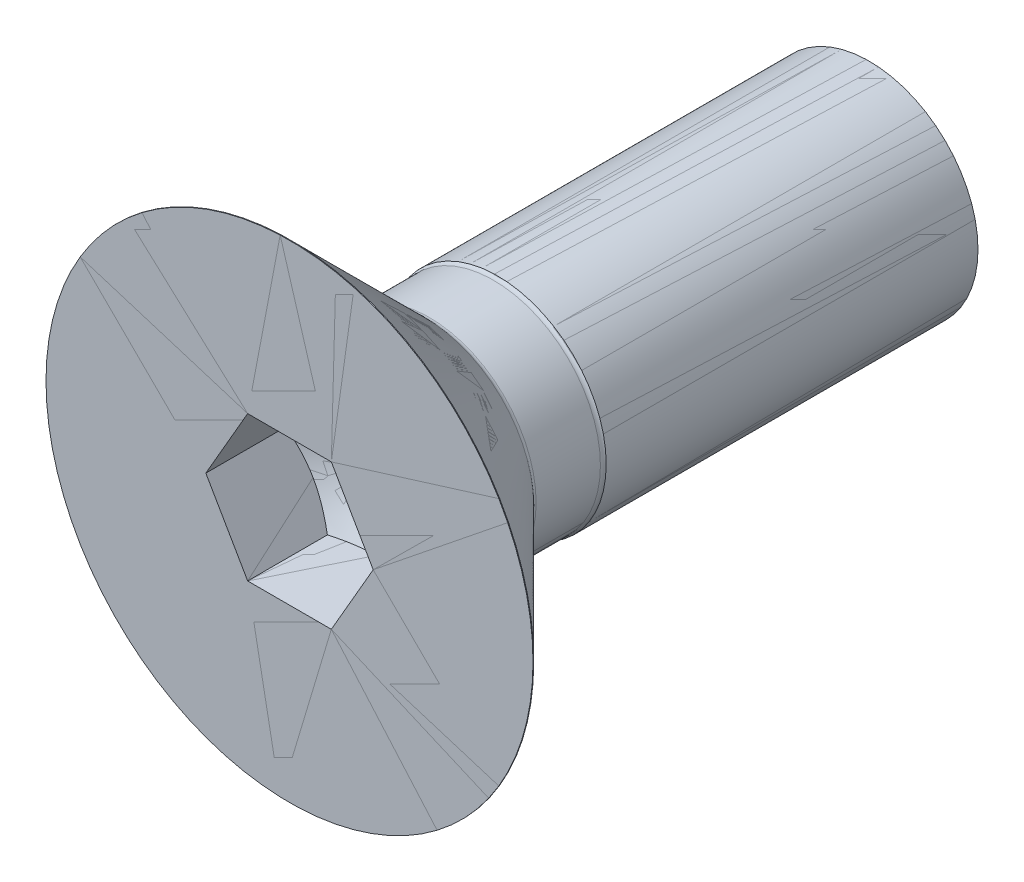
ISO-10303-21;
HEADER;
FILE_DESCRIPTION(('STEP AP214'),'2;1');
FILE_NAME('part.step','',(''),(''),'','','');
FILE_SCHEMA(('AUTOMOTIVE_DESIGN { 1 0 10303 214 1 1 1 1 }'));
ENDSEC;
DATA;
#1=APPLICATION_CONTEXT('core data for automotive mechanical design processes');
#2=APPLICATION_PROTOCOL_DEFINITION('international standard','automotive_design',2000,#1);
#3=PRODUCT_CONTEXT('',#1,'mechanical');
#4=PRODUCT('Part','Part','',(#3));
#5=PRODUCT_RELATED_PRODUCT_CATEGORY('part','',(#4));
#6=PRODUCT_DEFINITION_FORMATION('','',#4);
#7=PRODUCT_DEFINITION_CONTEXT('part definition',#1,'design');
#8=PRODUCT_DEFINITION('design','',#6,#7);
#9=PRODUCT_DEFINITION_SHAPE('','',#8);
#10=(LENGTH_UNIT() NAMED_UNIT(*) SI_UNIT(.MILLI.,.METRE.));
#11=(NAMED_UNIT(*) PLANE_ANGLE_UNIT() SI_UNIT($,.RADIAN.));
#12=(NAMED_UNIT(*) SI_UNIT($,.STERADIAN.) SOLID_ANGLE_UNIT());
#13=UNCERTAINTY_MEASURE_WITH_UNIT(LENGTH_MEASURE(1.E-05),#10,'distance_accuracy_value','');
#14=(GEOMETRIC_REPRESENTATION_CONTEXT(3) GLOBAL_UNCERTAINTY_ASSIGNED_CONTEXT((#13)) GLOBAL_UNIT_ASSIGNED_CONTEXT((#10,
#11,#12)) REPRESENTATION_CONTEXT('',''));
#15=CARTESIAN_POINT('',(0.,0.,0.));
#16=DIRECTION('',(0.,0.,1.));
#17=DIRECTION('',(1.,0.,0.));
#18=AXIS2_PLACEMENT_3D('',#15,#16,#17);
#19=CARTESIAN_POINT('',(0.,3.36,0.));
#20=DIRECTION('',(0.,0.,-0.999999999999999));
#21=DIRECTION('',(-1.,0.,0.));
#22=AXIS2_PLACEMENT_3D('',#19,#20,#21);
#23=PLANE('',#22);
#24=CARTESIAN_POINT('',(0.,0.,0.));
#25=DIRECTION('',(0.,0.,0.999999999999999));
#26=DIRECTION('',(1.,0.,0.));
#27=AXIS2_PLACEMENT_3D('',#24,#25,#26);
#28=CIRCLE('',#27,3.36);
#29=CARTESIAN_POINT('',(3.36,0.,0.));
#30=VERTEX_POINT('',#29);
#31=EDGE_CURVE('P0_E448',#30,#30,#28,.T.);
#32=ORIENTED_EDGE('',*,*,#31,.T.);
#33=EDGE_LOOP('',(#32));
#34=FACE_BOUND('',#33,.T.);
#35=DIRECTION('',(0.500000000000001,-0.866025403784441,0.));
#36=VECTOR('',#35,1.);
#37=CARTESIAN_POINT('',(0.577350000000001,0.999999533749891,0.));
#38=LINE('',#37,#36);
#39=CARTESIAN_POINT('',(0.577350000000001,0.999999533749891,0.));
#40=VERTEX_POINT('',#39);
#41=CARTESIAN_POINT('',(1.15470000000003,0.,0.));
#42=VERTEX_POINT('',#41);
#43=EDGE_CURVE('P0_E372',#40,#42,#38,.T.);
#44=ORIENTED_EDGE('',*,*,#43,.T.);
#45=DIRECTION('',(-0.500000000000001,-0.86602540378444,0.));
#46=VECTOR('',#45,1.);
#47=CARTESIAN_POINT('',(1.15470000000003,0.,0.));
#48=LINE('',#47,#46);
#49=CARTESIAN_POINT('',(0.577350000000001,-0.999999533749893,0.));
#50=VERTEX_POINT('',#49);
#51=EDGE_CURVE('P0_E514',#42,#50,#48,.T.);
#52=ORIENTED_EDGE('',*,*,#51,.T.);
#53=DIRECTION('',(-1.,0.,0.));
#54=VECTOR('',#53,1.);
#55=CARTESIAN_POINT('',(0.577350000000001,-0.999999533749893,0.));
#56=LINE('',#55,#54);
#57=CARTESIAN_POINT('',(-0.577349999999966,-0.999999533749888,0.));
#58=VERTEX_POINT('',#57);
#59=EDGE_CURVE('P0_E565',#50,#58,#56,.T.);
#60=ORIENTED_EDGE('',*,*,#59,.T.);
#61=DIRECTION('',(-0.500000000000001,0.866025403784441,0.));
#62=VECTOR('',#61,1.);
#63=CARTESIAN_POINT('',(-0.577349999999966,-0.999999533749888,0.));
#64=LINE('',#63,#62);
#65=CARTESIAN_POINT('',(-1.15469999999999,0.,0.));
#66=VERTEX_POINT('',#65);
#67=EDGE_CURVE('P0_E563',#58,#66,#64,.T.);
#68=ORIENTED_EDGE('',*,*,#67,.T.);
#69=DIRECTION('',(0.500000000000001,0.86602540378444,0.));
#70=VECTOR('',#69,1.);
#71=CARTESIAN_POINT('',(-1.15469999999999,0.,0.));
#72=LINE('',#71,#70);
#73=CARTESIAN_POINT('',(-0.577349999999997,0.999999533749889,0.));
#74=VERTEX_POINT('',#73);
#75=EDGE_CURVE('P0_E437',#66,#74,#72,.T.);
#76=ORIENTED_EDGE('',*,*,#75,.T.);
#77=DIRECTION('',(1.,0.,0.));
#78=VECTOR('',#77,1.);
#79=CARTESIAN_POINT('',(-0.577349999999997,0.999999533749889,0.));
#80=LINE('',#79,#78);
#81=EDGE_CURVE('P0_E433',#74,#40,#80,.T.);
#82=ORIENTED_EDGE('',*,*,#81,.T.);
#83=EDGE_LOOP('',(#44,#52,#60,#68,#76,#82));
#84=FACE_BOUND('',#83,.T.);
#85=ADVANCED_FACE('P0_F358',(#34,#84),#23,.F.);
#86=CARTESIAN_POINT('',(0.,0.,-7.99999999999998));
#87=DIRECTION('',(0.,0.,0.999999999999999));
#88=DIRECTION('',(1.,0.,0.));
#89=AXIS2_PLACEMENT_3D('',#86,#87,#88);
#90=PLANE('',#89);
#91=CARTESIAN_POINT('',(0.,0.,-7.99999999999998));
#92=DIRECTION('',(0.,0.,0.999999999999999));
#93=DIRECTION('',(1.,0.,0.));
#94=AXIS2_PLACEMENT_3D('',#91,#92,#93);
#95=CIRCLE('',#94,1.5);
#96=CARTESIAN_POINT('',(1.5,0.,-7.99999999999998));
#97=VERTEX_POINT('',#96);
#98=EDGE_CURVE('P0_E13',#97,#97,#95,.T.);
#99=ORIENTED_EDGE('',*,*,#98,.F.);
#100=EDGE_LOOP('',(#99));
#101=FACE_BOUND('',#100,.T.);
#102=ADVANCED_FACE('P0_F471',(#101),#90,.F.);
#103=CARTESIAN_POINT('',(0.,0.,0.));
#104=DIRECTION('',(0.,0.,0.999999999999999));
#105=DIRECTION('',(1.,0.,0.));
#106=AXIS2_PLACEMENT_3D('',#103,#104,#105);
#107=CYLINDRICAL_SURFACE('',#106,1.5);
#108=CARTESIAN_POINT('',(0.,0.,-2.87));
#109=DIRECTION('',(0.,0.,0.999999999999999));
#110=DIRECTION('',(1.,0.,0.));
#111=AXIS2_PLACEMENT_3D('',#108,#109,#110);
#112=CIRCLE('',#111,1.5);
#113=CARTESIAN_POINT('',(1.5,0.,-2.87));
#114=VERTEX_POINT('',#113);
#115=EDGE_CURVE('P0_E365',#114,#114,#112,.T.);
#116=CARTESIAN_POINT('',(1.5,0.,-2.87));
#117=CARTESIAN_POINT('',(1.5,0.,-2.9234375));
#118=CARTESIAN_POINT('',(1.5,0.,-2.976875));
#119=CARTESIAN_POINT('',(1.5,0.,-3.08375));
#120=CARTESIAN_POINT('',(1.5,0.,-3.1371875));
#121=CARTESIAN_POINT('',(1.5,0.,-3.2440625));
#122=CARTESIAN_POINT('',(1.5,0.,-3.2975));
#123=CARTESIAN_POINT('',(1.5,0.,-3.404375));
#124=CARTESIAN_POINT('',(1.5,0.,-3.4578125));
#125=CARTESIAN_POINT('',(1.5,0.,-3.5646875));
#126=CARTESIAN_POINT('',(1.5,0.,-3.618125));
#127=CARTESIAN_POINT('',(1.5,0.,-3.725));
#128=CARTESIAN_POINT('',(1.5,0.,-3.7784375));
#129=CARTESIAN_POINT('',(1.5,0.,-3.8853125));
#130=CARTESIAN_POINT('',(1.5,0.,-3.93875));
#131=CARTESIAN_POINT('',(1.5,0.,-4.045625));
#132=CARTESIAN_POINT('',(1.5,0.,-4.0990625));
#133=CARTESIAN_POINT('',(1.5,0.,-4.20593749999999));
#134=CARTESIAN_POINT('',(1.5,0.,-4.259375));
#135=CARTESIAN_POINT('',(1.5,0.,-4.36624999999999));
#136=CARTESIAN_POINT('',(1.5,0.,-4.41968749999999));
#137=CARTESIAN_POINT('',(1.5,0.,-4.52656249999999));
#138=CARTESIAN_POINT('',(1.5,0.,-4.57999999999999));
#139=CARTESIAN_POINT('',(1.5,0.,-4.68687499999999));
#140=CARTESIAN_POINT('',(1.5,0.,-4.74031249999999));
#141=CARTESIAN_POINT('',(1.5,0.,-4.84718749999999));
#142=CARTESIAN_POINT('',(1.5,0.,-4.90062499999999));
#143=CARTESIAN_POINT('',(1.5,0.,-5.00749999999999));
#144=CARTESIAN_POINT('',(1.5,0.,-5.06093749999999));
#145=CARTESIAN_POINT('',(1.5,0.,-5.16781249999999));
#146=CARTESIAN_POINT('',(1.5,0.,-5.22124999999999));
#147=CARTESIAN_POINT('',(1.5,0.,-5.32812499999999));
#148=CARTESIAN_POINT('',(1.5,0.,-5.38156249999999));
#149=CARTESIAN_POINT('',(1.5,0.,-5.48843749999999));
#150=CARTESIAN_POINT('',(1.5,0.,-5.54187499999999));
#151=CARTESIAN_POINT('',(1.5,0.,-5.64874999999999));
#152=CARTESIAN_POINT('',(1.5,0.,-5.70218749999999));
#153=CARTESIAN_POINT('',(1.5,0.,-5.80906249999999));
#154=CARTESIAN_POINT('',(1.5,0.,-5.86249999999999));
#155=CARTESIAN_POINT('',(1.5,0.,-5.96937499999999));
#156=CARTESIAN_POINT('',(1.5,0.,-6.02281249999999));
#157=CARTESIAN_POINT('',(1.5,0.,-6.12968749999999));
#158=CARTESIAN_POINT('',(1.5,0.,-6.18312499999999));
#159=CARTESIAN_POINT('',(1.5,0.,-6.28999999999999));
#160=CARTESIAN_POINT('',(1.5,0.,-6.34343749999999));
#161=CARTESIAN_POINT('',(1.5,0.,-6.45031249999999));
#162=CARTESIAN_POINT('',(1.5,0.,-6.50374999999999));
#163=CARTESIAN_POINT('',(1.5,0.,-6.61062499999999));
#164=CARTESIAN_POINT('',(1.5,0.,-6.66406249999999));
#165=CARTESIAN_POINT('',(1.5,0.,-6.77093749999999));
#166=CARTESIAN_POINT('',(1.5,0.,-6.82437499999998));
#167=CARTESIAN_POINT('',(1.5,0.,-6.93124999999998));
#168=CARTESIAN_POINT('',(1.5,0.,-6.98468749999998));
#169=CARTESIAN_POINT('',(1.5,0.,-7.09156249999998));
#170=CARTESIAN_POINT('',(1.5,0.,-7.14499999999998));
#171=CARTESIAN_POINT('',(1.5,0.,-7.25187499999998));
#172=CARTESIAN_POINT('',(1.5,0.,-7.30531249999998));
#173=CARTESIAN_POINT('',(1.5,0.,-7.41218749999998));
#174=CARTESIAN_POINT('',(1.5,0.,-7.46562499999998));
#175=CARTESIAN_POINT('',(1.5,0.,-7.57249999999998));
#176=CARTESIAN_POINT('',(1.5,0.,-7.62593749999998));
#177=CARTESIAN_POINT('',(1.5,0.,-7.73281249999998));
#178=CARTESIAN_POINT('',(1.5,0.,-7.78624999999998));
#179=CARTESIAN_POINT('',(1.5,0.,-7.89312499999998));
#180=CARTESIAN_POINT('',(1.5,0.,-7.94656249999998));
#181=CARTESIAN_POINT('',(1.5,0.,-7.99999999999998));
#182=B_SPLINE_CURVE_WITH_KNOTS('',3,(#116,#117,#118,#119,#120,#121,#122,#123,#124,#125,#126,
#127,#128,#129,#130,#131,#132,#133,#134,#135,#136,#137,#138,#139,#140,#141,#142,#143,#144,#145,
#146,#147,#148,#149,#150,#151,#152,#153,#154,#155,#156,#157,#158,#159,#160,#161,#162,#163,#164,
#165,#166,#167,#168,#169,#170,#171,#172,#173,#174,#175,#176,#177,#178,#179,#180,#181),
.UNSPECIFIED.,.F.,.F.,(4,2,2,2,2,2,2,2,2,2,2,2,2,2,2,2,2,2,2,2,2,2,2,2,2,2,2,2,2,2,2,2,4),(0.,
0.160312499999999,0.320624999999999,0.480937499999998,0.641249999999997,0.801562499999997,
0.961874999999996,1.1221875,1.28249999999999,1.44281249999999,1.60312499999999,1.76343749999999,
1.92374999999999,2.08406249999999,2.24437499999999,2.40468749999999,2.56499999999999,
2.72531249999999,2.88562499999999,3.04593749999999,3.20624999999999,3.36656249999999,
3.52687499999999,3.68718749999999,3.84749999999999,4.00781249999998,4.16812499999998,
4.32843749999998,4.48874999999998,4.64906249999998,4.80937499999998,4.96968749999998,
5.12999999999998),.UNSPECIFIED.);
#183=EDGE_CURVE('P0_BSEAM468',#114,#97,#182,.T.);
#184=ORIENTED_EDGE('',*,*,#115,.F.);
#185=ORIENTED_EDGE('',*,*,#98,.T.);
#186=ORIENTED_EDGE('',*,*,#183,.T.);
#187=ORIENTED_EDGE('',*,*,#183,.F.);
#188=EDGE_LOOP('',(#184,#186,#185,#187));
#189=FACE_BOUND('',#188,.T.);
#190=ADVANCED_FACE('P0_F468',(#189),#107,.T.);
#191=CARTESIAN_POINT('',(0.,0.,-2.81343145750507));
#192=DIRECTION('',(0.,0.,0.999999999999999));
#193=DIRECTION('',(1.,0.,0.));
#194=AXIS2_PLACEMENT_3D('',#191,#192,#193);
#195=TOROIDAL_SURFACE('',#194,1.55656854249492,0.08);
#196=ORIENTED_EDGE('',*,*,#115,.T.);
#197=EDGE_LOOP('',(#196));
#198=FACE_BOUND('',#197,.T.);
#199=CARTESIAN_POINT('',(0.,0.,-2.81343145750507));
#200=DIRECTION('',(0.,0.,0.999999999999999));
#201=DIRECTION('',(1.,0.,0.));
#202=AXIS2_PLACEMENT_3D('',#199,#200,#201);
#203=CIRCLE('',#202,1.47656854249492);
#204=CARTESIAN_POINT('',(1.47656854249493,0.,-2.81343145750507));
#205=VERTEX_POINT('',#204);
#206=EDGE_CURVE('P0_E460',#205,#205,#203,.T.);
#207=ORIENTED_EDGE('',*,*,#206,.F.);
#208=EDGE_LOOP('',(#207));
#209=FACE_BOUND('',#208,.T.);
#210=ADVANCED_FACE('P0_F465',(#198,#209),#195,.F.);
#211=CARTESIAN_POINT('',(0.,0.,0.));
#212=DIRECTION('',(0.,0.,0.999999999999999));
#213=DIRECTION('',(1.,0.,0.));
#214=AXIS2_PLACEMENT_3D('',#211,#212,#213);
#215=CYLINDRICAL_SURFACE('',#214,1.47656854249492);
#216=CARTESIAN_POINT('',(0.,0.,-1.92656854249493));
#217=DIRECTION('',(0.,0.,0.999999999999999));
#218=DIRECTION('',(1.,0.,0.));
#219=AXIS2_PLACEMENT_3D('',#216,#217,#218);
#220=CIRCLE('',#219,1.47656854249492);
#221=CARTESIAN_POINT('',(1.47656854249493,0.,-1.92656854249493));
#222=VERTEX_POINT('',#221);
#223=EDGE_CURVE('P0_E457',#222,#222,#220,.T.);
#224=CARTESIAN_POINT('',(1.47656854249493,0.,-1.92656854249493));
#225=CARTESIAN_POINT('',(1.47656854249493,0.,-1.93580669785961));
#226=CARTESIAN_POINT('',(1.47656854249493,0.,-1.9450448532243));
#227=CARTESIAN_POINT('',(1.47656854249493,0.,-1.96352116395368));
#228=CARTESIAN_POINT('',(1.47656854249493,0.,-1.97275931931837));
#229=CARTESIAN_POINT('',(1.47656854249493,0.,-1.99123563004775));
#230=CARTESIAN_POINT('',(1.47656854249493,0.,-2.00047378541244));
#231=CARTESIAN_POINT('',(1.47656854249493,0.,-2.01895009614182));
#232=CARTESIAN_POINT('',(1.47656854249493,0.,-2.0281882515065));
#233=CARTESIAN_POINT('',(1.47656854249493,0.,-2.04666456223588));
#234=CARTESIAN_POINT('',(1.47656854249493,0.,-2.05590271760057));
#235=CARTESIAN_POINT('',(1.47656854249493,0.,-2.07437902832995));
#236=CARTESIAN_POINT('',(1.47656854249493,0.,-2.08361718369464));
#237=CARTESIAN_POINT('',(1.47656854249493,0.,-2.10209349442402));
#238=CARTESIAN_POINT('',(1.47656854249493,0.,-2.11133164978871));
#239=CARTESIAN_POINT('',(1.47656854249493,0.,-2.12980796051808));
#240=CARTESIAN_POINT('',(1.47656854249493,0.,-2.13904611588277));
#241=CARTESIAN_POINT('',(1.47656854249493,0.,-2.15752242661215));
#242=CARTESIAN_POINT('',(1.47656854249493,0.,-2.16676058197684));
#243=CARTESIAN_POINT('',(1.47656854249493,0.,-2.18523689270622));
#244=CARTESIAN_POINT('',(1.47656854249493,0.,-2.19447504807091));
#245=CARTESIAN_POINT('',(1.47656854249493,0.,-2.21295135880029));
#246=CARTESIAN_POINT('',(1.47656854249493,0.,-2.22218951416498));
#247=CARTESIAN_POINT('',(1.47656854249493,0.,-2.24066582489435));
#248=CARTESIAN_POINT('',(1.47656854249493,0.,-2.24990398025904));
#249=CARTESIAN_POINT('',(1.47656854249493,0.,-2.26838029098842));
#250=CARTESIAN_POINT('',(1.47656854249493,0.,-2.27761844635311));
#251=CARTESIAN_POINT('',(1.47656854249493,0.,-2.29609475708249));
#252=CARTESIAN_POINT('',(1.47656854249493,0.,-2.30533291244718));
#253=CARTESIAN_POINT('',(1.47656854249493,0.,-2.32380922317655));
#254=CARTESIAN_POINT('',(1.47656854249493,0.,-2.33304737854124));
#255=CARTESIAN_POINT('',(1.47656854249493,0.,-2.35152368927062));
#256=CARTESIAN_POINT('',(1.47656854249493,0.,-2.36076184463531));
#257=CARTESIAN_POINT('',(1.47656854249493,0.,-2.37923815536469));
#258=CARTESIAN_POINT('',(1.47656854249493,0.,-2.38847631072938));
#259=CARTESIAN_POINT('',(1.47656854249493,0.,-2.40695262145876));
#260=CARTESIAN_POINT('',(1.47656854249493,0.,-2.41619077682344));
#261=CARTESIAN_POINT('',(1.47656854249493,0.,-2.43466708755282));
#262=CARTESIAN_POINT('',(1.47656854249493,0.,-2.44390524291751));
#263=CARTESIAN_POINT('',(1.47656854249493,0.,-2.46238155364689));
#264=CARTESIAN_POINT('',(1.47656854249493,0.,-2.47161970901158));
#265=CARTESIAN_POINT('',(1.47656854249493,0.,-2.49009601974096));
#266=CARTESIAN_POINT('',(1.47656854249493,0.,-2.49933417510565));
#267=CARTESIAN_POINT('',(1.47656854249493,0.,-2.51781048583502));
#268=CARTESIAN_POINT('',(1.47656854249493,0.,-2.52704864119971));
#269=CARTESIAN_POINT('',(1.47656854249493,0.,-2.54552495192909));
#270=CARTESIAN_POINT('',(1.47656854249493,0.,-2.55476310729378));
#271=CARTESIAN_POINT('',(1.47656854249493,0.,-2.57323941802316));
#272=CARTESIAN_POINT('',(1.47656854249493,0.,-2.58247757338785));
#273=CARTESIAN_POINT('',(1.47656854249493,0.,-2.60095388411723));
#274=CARTESIAN_POINT('',(1.47656854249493,0.,-2.61019203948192));
#275=CARTESIAN_POINT('',(1.47656854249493,0.,-2.62866835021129));
#276=CARTESIAN_POINT('',(1.47656854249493,0.,-2.63790650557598));
#277=CARTESIAN_POINT('',(1.47656854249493,0.,-2.65638281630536));
#278=CARTESIAN_POINT('',(1.47656854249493,0.,-2.66562097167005));
#279=CARTESIAN_POINT('',(1.47656854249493,0.,-2.68409728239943));
#280=CARTESIAN_POINT('',(1.47656854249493,0.,-2.69333543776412));
#281=CARTESIAN_POINT('',(1.47656854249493,0.,-2.71181174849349));
#282=CARTESIAN_POINT('',(1.47656854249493,0.,-2.72104990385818));
#283=CARTESIAN_POINT('',(1.47656854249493,0.,-2.73952621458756));
#284=CARTESIAN_POINT('',(1.47656854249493,0.,-2.74876436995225));
#285=CARTESIAN_POINT('',(1.47656854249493,0.,-2.76724068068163));
#286=CARTESIAN_POINT('',(1.47656854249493,0.,-2.77647883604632));
#287=CARTESIAN_POINT('',(1.47656854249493,0.,-2.7949551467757));
#288=CARTESIAN_POINT('',(1.47656854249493,0.,-2.80419330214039));
#289=CARTESIAN_POINT('',(1.47656854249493,0.,-2.81343145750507));
#290=B_SPLINE_CURVE_WITH_KNOTS('',3,(#224,#225,#226,#227,#228,#229,#230,#231,#232,#233,#234,
#235,#236,#237,#238,#239,#240,#241,#242,#243,#244,#245,#246,#247,#248,#249,#250,#251,#252,#253,
#254,#255,#256,#257,#258,#259,#260,#261,#262,#263,#264,#265,#266,#267,#268,#269,#270,#271,#272,
#273,#274,#275,#276,#277,#278,#279,#280,#281,#282,#283,#284,#285,#286,#287,#288,#289),
.UNSPECIFIED.,.F.,.F.,(4,2,2,2,2,2,2,2,2,2,2,2,2,2,2,2,2,2,2,2,2,2,2,2,2,2,2,2,2,2,2,2,4),(0.,
0.0277144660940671,0.0554289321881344,0.0831433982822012,0.110857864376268,0.138572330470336,
0.166286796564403,0.19400126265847,0.221715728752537,0.249430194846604,0.277144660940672,
0.304859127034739,0.332573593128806,0.360288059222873,0.38800252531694,0.415716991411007,
0.443431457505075,0.471145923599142,0.498860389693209,0.526574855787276,0.554289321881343,
0.582003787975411,0.609718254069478,0.637432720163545,0.665147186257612,0.692861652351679,
0.720576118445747,0.748290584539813,0.776005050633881,0.803719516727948,0.831433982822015,
0.859148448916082,0.886862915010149),.UNSPECIFIED.);
#291=EDGE_CURVE('P0_BSEAM483',#222,#205,#290,.T.);
#292=ORIENTED_EDGE('',*,*,#223,.F.);
#293=ORIENTED_EDGE('',*,*,#206,.T.);
#294=ORIENTED_EDGE('',*,*,#291,.T.);
#295=ORIENTED_EDGE('',*,*,#291,.F.);
#296=EDGE_LOOP('',(#292,#294,#293,#295));
#297=FACE_BOUND('',#296,.T.);
#298=ADVANCED_FACE('P0_F483',(#297),#215,.T.);
#299=CARTESIAN_POINT('',(0.,0.,-1.92656854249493));
#300=DIRECTION('',(0.,0.,0.999999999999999));
#301=DIRECTION('',(1.,0.,0.));
#302=AXIS2_PLACEMENT_3D('',#299,#300,#301);
#303=TOROIDAL_SURFACE('',#302,1.55656854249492,0.08);
#304=ORIENTED_EDGE('',*,*,#223,.T.);
#305=EDGE_LOOP('',(#304));
#306=FACE_BOUND('',#305,.T.);
#307=CARTESIAN_POINT('',(0.,0.,-1.87));
#308=DIRECTION('',(0.,0.,0.999999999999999));
#309=DIRECTION('',(1.,0.,0.));
#310=AXIS2_PLACEMENT_3D('',#307,#308,#309);
#311=CIRCLE('',#310,1.5);
#312=CARTESIAN_POINT('',(1.5,0.,-1.87));
#313=VERTEX_POINT('',#312);
#314=EDGE_CURVE('P0_E454',#313,#313,#311,.T.);
#315=ORIENTED_EDGE('',*,*,#314,.F.);
#316=EDGE_LOOP('',(#315));
#317=FACE_BOUND('',#316,.T.);
#318=ADVANCED_FACE('P0_F486',(#306,#317),#303,.F.);
#319=CARTESIAN_POINT('',(0.,0.,-1.87));
#320=DIRECTION('',(0.,0.,0.999999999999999));
#321=DIRECTION('',(1.,0.,0.));
#322=AXIS2_PLACEMENT_3D('',#319,#320,#321);
#323=CONICAL_SURFACE('',#322,1.5,0.785398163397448);
#324=CARTESIAN_POINT('',(0.,0.,-0.01));
#325=DIRECTION('',(0.,0.,0.999999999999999));
#326=DIRECTION('',(1.,0.,0.));
#327=AXIS2_PLACEMENT_3D('',#324,#325,#326);
#328=CIRCLE('',#327,3.36);
#329=CARTESIAN_POINT('',(3.36000000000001,0.,-0.01));
#330=VERTEX_POINT('',#329);
#331=EDGE_CURVE('P0_E451',#330,#330,#328,.T.);
#332=CARTESIAN_POINT('',(3.36000000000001,0.,-0.01));
#333=CARTESIAN_POINT('',(3.34062500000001,0.,-0.029375));
#334=CARTESIAN_POINT('',(3.32125000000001,0.,-0.04875));
#335=CARTESIAN_POINT('',(3.28250000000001,0.,-0.0875000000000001));
#336=CARTESIAN_POINT('',(3.26312500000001,0.,-0.106875));
#337=CARTESIAN_POINT('',(3.22437500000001,0.,-0.145625));
#338=CARTESIAN_POINT('',(3.20500000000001,0.,-0.165));
#339=CARTESIAN_POINT('',(3.16625000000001,0.,-0.20375));
#340=CARTESIAN_POINT('',(3.14687500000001,0.,-0.223125));
#341=CARTESIAN_POINT('',(3.10812500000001,0.,-0.261875));
#342=CARTESIAN_POINT('',(3.08875000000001,0.,-0.28125));
#343=CARTESIAN_POINT('',(3.05000000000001,0.,-0.32));
#344=CARTESIAN_POINT('',(3.03062500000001,0.,-0.339375));
#345=CARTESIAN_POINT('',(2.99187500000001,0.,-0.378125));
#346=CARTESIAN_POINT('',(2.97250000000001,0.,-0.3975));
#347=CARTESIAN_POINT('',(2.93375000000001,0.,-0.43625));
#348=CARTESIAN_POINT('',(2.91437500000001,0.,-0.455625));
#349=CARTESIAN_POINT('',(2.87562500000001,0.,-0.494375));
#350=CARTESIAN_POINT('',(2.85625000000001,0.,-0.51375));
#351=CARTESIAN_POINT('',(2.81750000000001,0.,-0.5525));
#352=CARTESIAN_POINT('',(2.79812500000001,0.,-0.571875));
#353=CARTESIAN_POINT('',(2.759375,0.,-0.610625));
#354=CARTESIAN_POINT('',(2.74000000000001,0.,-0.63));
#355=CARTESIAN_POINT('',(2.70125,0.,-0.66875));
#356=CARTESIAN_POINT('',(2.681875,0.,-0.688125));
#357=CARTESIAN_POINT('',(2.643125,0.,-0.726875));
#358=CARTESIAN_POINT('',(2.62375,0.,-0.74625));
#359=CARTESIAN_POINT('',(2.585,0.,-0.785));
#360=CARTESIAN_POINT('',(2.565625,0.,-0.804375));
#361=CARTESIAN_POINT('',(2.526875,0.,-0.843125));
#362=CARTESIAN_POINT('',(2.5075,0.,-0.8625));
#363=CARTESIAN_POINT('',(2.46875,0.,-0.90125));
#364=CARTESIAN_POINT('',(2.449375,0.,-0.920625));
#365=CARTESIAN_POINT('',(2.410625,0.,-0.959375));
#366=CARTESIAN_POINT('',(2.39125,0.,-0.97875));
#367=CARTESIAN_POINT('',(2.3525,0.,-1.0175));
#368=CARTESIAN_POINT('',(2.333125,0.,-1.036875));
#369=CARTESIAN_POINT('',(2.294375,0.,-1.075625));
#370=CARTESIAN_POINT('',(2.275,0.,-1.095));
#371=CARTESIAN_POINT('',(2.23625,0.,-1.13375));
#372=CARTESIAN_POINT('',(2.216875,0.,-1.153125));
#373=CARTESIAN_POINT('',(2.178125,0.,-1.191875));
#374=CARTESIAN_POINT('',(2.15875,0.,-1.21125));
#375=CARTESIAN_POINT('',(2.12,0.,-1.25));
#376=CARTESIAN_POINT('',(2.100625,0.,-1.269375));
#377=CARTESIAN_POINT('',(2.061875,0.,-1.308125));
#378=CARTESIAN_POINT('',(2.0425,0.,-1.3275));
#379=CARTESIAN_POINT('',(2.00375,0.,-1.36625));
#380=CARTESIAN_POINT('',(1.984375,0.,-1.385625));
#381=CARTESIAN_POINT('',(1.945625,0.,-1.424375));
#382=CARTESIAN_POINT('',(1.92625,0.,-1.44375));
#383=CARTESIAN_POINT('',(1.8875,0.,-1.4825));
#384=CARTESIAN_POINT('',(1.868125,0.,-1.501875));
#385=CARTESIAN_POINT('',(1.829375,0.,-1.540625));
#386=CARTESIAN_POINT('',(1.81,0.,-1.56));
#387=CARTESIAN_POINT('',(1.77125,0.,-1.59875));
#388=CARTESIAN_POINT('',(1.751875,0.,-1.618125));
#389=CARTESIAN_POINT('',(1.713125,0.,-1.656875));
#390=CARTESIAN_POINT('',(1.69375,0.,-1.67625));
#391=CARTESIAN_POINT('',(1.655,0.,-1.715));
#392=CARTESIAN_POINT('',(1.635625,0.,-1.734375));
#393=CARTESIAN_POINT('',(1.596875,0.,-1.773125));
#394=CARTESIAN_POINT('',(1.5775,0.,-1.7925));
#395=CARTESIAN_POINT('',(1.53875,0.,-1.83125));
#396=CARTESIAN_POINT('',(1.519375,0.,-1.850625));
#397=CARTESIAN_POINT('',(1.5,0.,-1.87));
#398=B_SPLINE_CURVE_WITH_KNOTS('',3,(#332,#333,#334,#335,#336,#337,#338,#339,#340,#341,#342,
#343,#344,#345,#346,#347,#348,#349,#350,#351,#352,#353,#354,#355,#356,#357,#358,#359,#360,#361,
#362,#363,#364,#365,#366,#367,#368,#369,#370,#371,#372,#373,#374,#375,#376,#377,#378,#379,#380,
#381,#382,#383,#384,#385,#386,#387,#388,#389,#390,#391,#392,#393,#394,#395,#396,#397),
.UNSPECIFIED.,.F.,.F.,(4,2,2,2,2,2,2,2,2,2,2,2,2,2,2,2,2,2,2,2,2,2,2,2,2,2,2,2,2,2,2,2,4),(0.,
0.0822011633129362,0.164402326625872,0.246603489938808,0.328804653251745,0.411005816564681,
0.493206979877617,0.575408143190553,0.65760930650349,0.739810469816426,0.822011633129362,
0.904212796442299,0.986413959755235,1.06861512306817,1.15081628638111,1.23301744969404,
1.31521861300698,1.39741977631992,1.47962093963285,1.56182210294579,1.64402326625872,
1.72622442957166,1.8084255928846,1.89062675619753,1.97282791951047,2.05502908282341,
2.13723024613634,2.21943140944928,2.30163257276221,2.38383373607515,2.46603489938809,
2.54823606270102,2.63043722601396),.UNSPECIFIED.);
#399=EDGE_CURVE('P0_BSEAM490',#330,#313,#398,.T.);
#400=ORIENTED_EDGE('',*,*,#331,.F.);
#401=ORIENTED_EDGE('',*,*,#314,.T.);
#402=ORIENTED_EDGE('',*,*,#399,.T.);
#403=ORIENTED_EDGE('',*,*,#399,.F.);
#404=EDGE_LOOP('',(#400,#402,#401,#403));
#405=FACE_BOUND('',#404,.T.);
#406=ADVANCED_FACE('P0_F490',(#405),#323,.T.);
#407=CARTESIAN_POINT('',(0.,0.,0.));
#408=DIRECTION('',(0.,0.,0.999999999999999));
#409=DIRECTION('',(1.,0.,0.));
#410=AXIS2_PLACEMENT_3D('',#407,#408,#409);
#411=CYLINDRICAL_SURFACE('',#410,3.36);
#412=CARTESIAN_POINT('',(3.36,0.,0.));
#413=CARTESIAN_POINT('',(3.36,0.,-0.000104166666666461));
#414=CARTESIAN_POINT('',(3.36,0.,-0.000208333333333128));
#415=CARTESIAN_POINT('',(3.36,0.,-0.000416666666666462));
#416=CARTESIAN_POINT('',(3.36,0.,-0.000520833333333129));
#417=CARTESIAN_POINT('',(3.36,0.,-0.000729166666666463));
#418=CARTESIAN_POINT('',(3.36,0.,-0.00083333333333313));
#419=CARTESIAN_POINT('',(3.36,0.,-0.00104166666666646));
#420=CARTESIAN_POINT('',(3.36,0.,-0.00114583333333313));
#421=CARTESIAN_POINT('',(3.36,0.,-0.00135416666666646));
#422=CARTESIAN_POINT('',(3.36,0.,-0.00145833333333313));
#423=CARTESIAN_POINT('',(3.36,0.,-0.00166666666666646));
#424=CARTESIAN_POINT('',(3.36,0.,-0.00177083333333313));
#425=CARTESIAN_POINT('',(3.36,0.,-0.00197916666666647));
#426=CARTESIAN_POINT('',(3.36,0.,-0.00208333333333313));
#427=CARTESIAN_POINT('',(3.36,0.,-0.00229166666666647));
#428=CARTESIAN_POINT('',(3.36,0.,-0.00239583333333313));
#429=CARTESIAN_POINT('',(3.36,0.,-0.00260416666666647));
#430=CARTESIAN_POINT('',(3.36,0.,-0.00270833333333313));
#431=CARTESIAN_POINT('',(3.36,0.,-0.00291666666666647));
#432=CARTESIAN_POINT('',(3.36,0.,-0.00302083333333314));
#433=CARTESIAN_POINT('',(3.36,0.,-0.00322916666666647));
#434=CARTESIAN_POINT('',(3.36,0.,-0.00333333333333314));
#435=CARTESIAN_POINT('',(3.36,0.,-0.00354166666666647));
#436=CARTESIAN_POINT('',(3.36,0.,-0.00364583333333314));
#437=CARTESIAN_POINT('',(3.36,0.,-0.00385416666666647));
#438=CARTESIAN_POINT('',(3.36,0.,-0.00395833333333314));
#439=CARTESIAN_POINT('',(3.36,0.,-0.00416666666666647));
#440=CARTESIAN_POINT('',(3.36,0.,-0.00427083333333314));
#441=CARTESIAN_POINT('',(3.36,0.,-0.00447916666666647));
#442=CARTESIAN_POINT('',(3.36,0.,-0.00458333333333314));
#443=CARTESIAN_POINT('',(3.36,0.,-0.00479166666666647));
#444=CARTESIAN_POINT('',(3.36,0.,-0.00489583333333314));
#445=CARTESIAN_POINT('',(3.36,0.,-0.00510416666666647));
#446=CARTESIAN_POINT('',(3.36,0.,-0.00520833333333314));
#447=CARTESIAN_POINT('',(3.36,0.,-0.00541666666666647));
#448=CARTESIAN_POINT('',(3.36,0.,-0.00552083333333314));
#449=CARTESIAN_POINT('',(3.36,0.,-0.00572916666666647));
#450=CARTESIAN_POINT('',(3.36,0.,-0.00583333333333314));
#451=CARTESIAN_POINT('',(3.36,0.,-0.00604166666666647));
#452=CARTESIAN_POINT('',(3.36,0.,-0.00614583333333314));
#453=CARTESIAN_POINT('',(3.36,0.,-0.00635416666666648));
#454=CARTESIAN_POINT('',(3.36,0.,-0.00645833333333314));
#455=CARTESIAN_POINT('',(3.36,0.,-0.00666666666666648));
#456=CARTESIAN_POINT('',(3.36,0.,-0.00677083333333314));
#457=CARTESIAN_POINT('',(3.36,0.,-0.00697916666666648));
#458=CARTESIAN_POINT('',(3.36,0.,-0.00708333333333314));
#459=CARTESIAN_POINT('',(3.36,0.,-0.00729166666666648));
#460=CARTESIAN_POINT('',(3.36,0.,-0.00739583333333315));
#461=CARTESIAN_POINT('',(3.36,0.,-0.00760416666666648));
#462=CARTESIAN_POINT('',(3.36,0.,-0.00770833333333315));
#463=CARTESIAN_POINT('',(3.36,0.,-0.00791666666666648));
#464=CARTESIAN_POINT('',(3.36,0.,-0.00802083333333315));
#465=CARTESIAN_POINT('',(3.36,0.,-0.00822916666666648));
#466=CARTESIAN_POINT('',(3.36,0.,-0.00833333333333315));
#467=CARTESIAN_POINT('',(3.36,0.,-0.00854166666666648));
#468=CARTESIAN_POINT('',(3.36,0.,-0.00864583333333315));
#469=CARTESIAN_POINT('',(3.36,0.,-0.00885416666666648));
#470=CARTESIAN_POINT('',(3.36,0.,-0.00895833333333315));
#471=CARTESIAN_POINT('',(3.36,0.,-0.00916666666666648));
#472=CARTESIAN_POINT('',(3.36,0.,-0.00927083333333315));
#473=CARTESIAN_POINT('',(3.36,0.,-0.00947916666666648));
#474=CARTESIAN_POINT('',(3.36,0.,-0.00958333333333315));
#475=CARTESIAN_POINT('',(3.36,0.,-0.00979166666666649));
#476=CARTESIAN_POINT('',(3.36,0.,-0.00989583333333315));
#477=CARTESIAN_POINT('',(3.36,0.,-0.00999999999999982));
#478=B_SPLINE_CURVE_WITH_KNOTS('',3,(#412,#413,#414,#415,#416,#417,#418,#419,#420,#421,#422,
#423,#424,#425,#426,#427,#428,#429,#430,#431,#432,#433,#434,#435,#436,#437,#438,#439,#440,#441,
#442,#443,#444,#445,#446,#447,#448,#449,#450,#451,#452,#453,#454,#455,#456,#457,#458,#459,#460,
#461,#462,#463,#464,#465,#466,#467,#468,#469,#470,#471,#472,#473,#474,#475,#476,#477),
.UNSPECIFIED.,.F.,.F.,(4,2,2,2,2,2,2,2,2,2,2,2,2,2,2,2,2,2,2,2,2,2,2,2,2,2,2,2,2,2,2,2,4),(0.,
0.000312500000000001,0.000625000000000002,0.000937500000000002,0.00125,0.0015625,0.001875,
0.0021875,0.00250000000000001,0.00281250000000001,0.00312500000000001,0.00343750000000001,
0.00375000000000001,0.00406250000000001,0.00437500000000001,0.00468750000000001,
0.00500000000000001,0.00531250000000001,0.00562500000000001,0.00593750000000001,
0.00625000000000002,0.00656250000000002,0.00687500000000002,0.00718750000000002,
0.00750000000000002,0.00781250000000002,0.00812500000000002,0.00843750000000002,
0.00875000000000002,0.00906250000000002,0.00937500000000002,0.00968750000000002,0.01),.UNSPECIFIED.);
#479=EDGE_CURVE('P0_BSEAM494',#30,#330,#478,.T.);
#480=ORIENTED_EDGE('',*,*,#31,.F.);
#481=ORIENTED_EDGE('',*,*,#331,.T.);
#482=ORIENTED_EDGE('',*,*,#479,.T.);
#483=ORIENTED_EDGE('',*,*,#479,.F.);
#484=EDGE_LOOP('',(#480,#482,#481,#483));
#485=FACE_BOUND('',#484,.T.);
#486=ADVANCED_FACE('P0_F494',(#485),#411,.T.);
#487=CARTESIAN_POINT('',(0.577350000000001,0.999999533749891,-1.76666635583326));
#488=DIRECTION('',(-0.866025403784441,-0.500000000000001,0.));
#489=DIRECTION('',(-0.500000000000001,0.866025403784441,0.));
#490=AXIS2_PLACEMENT_3D('',#487,#488,#489);
#491=PLANE('',#490);
#492=DIRECTION('',(0.,0.,0.999999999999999));
#493=VECTOR('',#492,1.);
#494=CARTESIAN_POINT('',(1.15470000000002,0.,-1.76666635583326));
#495=LINE('',#494,#493);
#496=CARTESIAN_POINT('',(1.15470000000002,0.,-1.1));
#497=VERTEX_POINT('',#496);
#498=EDGE_CURVE('P0_E446',#497,#42,#495,.T.);
#499=ORIENTED_EDGE('',*,*,#498,.T.);
#500=ORIENTED_EDGE('',*,*,#43,.F.);
#501=DIRECTION('',(0.,0.,0.999999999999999));
#502=VECTOR('',#501,1.);
#503=CARTESIAN_POINT('',(0.577350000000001,0.999999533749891,-1.76666635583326));
#504=LINE('',#503,#502);
#505=CARTESIAN_POINT('',(0.577350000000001,0.999999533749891,-1.1));
#506=VERTEX_POINT('',#505);
#507=EDGE_CURVE('P0_E427',#506,#40,#504,.T.);
#508=ORIENTED_EDGE('',*,*,#507,.F.);
#509=CARTESIAN_POINT('',(1.15470011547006,-2.00000002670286E-07,-1.09999993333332));
#510=CARTESIAN_POINT('',(1.1293290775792,0.0439437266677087,-1.11465215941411));
#511=CARTESIAN_POINT('',(1.1037390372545,0.0882669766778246,-1.12797759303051));
#512=CARTESIAN_POINT('',(1.05211588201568,0.17768090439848,-1.15123673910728));
#513=CARTESIAN_POINT('',(1.0260818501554,0.222773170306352,-1.16116222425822));
#514=CARTESIAN_POINT('',(0.974336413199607,0.312398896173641,-1.17661196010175));
#515=CARTESIAN_POINT('',(0.948632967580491,0.356918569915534,-1.18223904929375));
#516=CARTESIAN_POINT('',(0.897105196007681,0.446167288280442,-1.18895536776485));
#517=CARTESIAN_POINT('',(0.87128105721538,0.490896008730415,-1.19005016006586));
#518=CARTESIAN_POINT('',(0.823031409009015,0.574466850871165,-1.18776682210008));
#519=CARTESIAN_POINT('',(0.800598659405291,0.613321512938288,-1.18494932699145));
#520=CARTESIAN_POINT('',(0.755879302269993,0.690777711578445,-1.17602132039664));
#521=CARTESIAN_POINT('',(0.733592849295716,0.729378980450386,-1.16990776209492));
#522=CARTESIAN_POINT('',(0.688781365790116,0.806994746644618,-1.15462504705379));
#523=CARTESIAN_POINT('',(0.666262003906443,0.845999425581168,-1.14539113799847));
#524=CARTESIAN_POINT('',(0.621559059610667,0.92342719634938,-1.1244340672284));
#525=CARTESIAN_POINT('',(0.599374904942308,0.961851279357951,-1.11271582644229));
#526=CARTESIAN_POINT('',(0.577349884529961,0.999999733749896,-1.09999993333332));
#527=B_SPLINE_CURVE_WITH_KNOTS('',3,(#509,#510,#511,#512,#513,#514,#515,#516,#517,#518,#519,
#520,#521,#522,#523,#524,#525,#526),.UNSPECIFIED.,.F.,.F.,(4,2,2,2,2,2,2,2,4),(0.,
0.158507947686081,0.31739679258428,0.472353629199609,0.627120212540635,0.761853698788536,
0.89671194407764,1.03456070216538,1.17213892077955),.UNSPECIFIED.);
#528=EDGE_CURVE('P0_E420',#497,#506,#527,.T.);
#529=ORIENTED_EDGE('',*,*,#528,.F.);
#530=EDGE_LOOP('',(#499,#500,#508,#529));
#531=FACE_BOUND('',#530,.T.);
#532=ADVANCED_FACE('P0_F428',(#531),#491,.T.);
#533=CARTESIAN_POINT('',(1.15470000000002,0.,-1.76666635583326));
#534=DIRECTION('',(-0.86602540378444,0.500000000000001,0.));
#535=DIRECTION('',(0.500000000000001,0.86602540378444,0.));
#536=AXIS2_PLACEMENT_3D('',#533,#534,#535);
#537=PLANE('',#536);
#538=DIRECTION('',(0.,0.,0.999999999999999));
#539=VECTOR('',#538,1.);
#540=CARTESIAN_POINT('',(0.577350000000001,-0.999999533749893,-1.76666635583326));
#541=LINE('',#540,#539);
#542=CARTESIAN_POINT('',(0.577350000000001,-0.999999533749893,-1.1));
#543=VERTEX_POINT('',#542);
#544=EDGE_CURVE('P0_E444',#543,#50,#541,.T.);
#545=ORIENTED_EDGE('',*,*,#544,.T.);
#546=ORIENTED_EDGE('',*,*,#51,.F.);
#547=ORIENTED_EDGE('',*,*,#498,.F.);
#548=CARTESIAN_POINT('',(0.577349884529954,-0.999999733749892,-1.09999993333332));
#549=CARTESIAN_POINT('',(0.602720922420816,-0.956055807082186,-1.1146521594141));
#550=CARTESIAN_POINT('',(0.628310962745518,-0.911732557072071,-1.1279775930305));
#551=CARTESIAN_POINT('',(0.679934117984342,-0.822318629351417,-1.15123673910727));
#552=CARTESIAN_POINT('',(0.705968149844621,-0.777226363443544,-1.16116222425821));
#553=CARTESIAN_POINT('',(0.757713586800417,-0.687600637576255,-1.17661196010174));
#554=CARTESIAN_POINT('',(0.783417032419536,-0.643080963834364,-1.18223904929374));
#555=CARTESIAN_POINT('',(0.834944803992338,-0.553832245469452,-1.18895536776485));
#556=CARTESIAN_POINT('',(0.860768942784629,-0.509103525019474,-1.19005016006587));
#557=CARTESIAN_POINT('',(0.909018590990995,-0.425532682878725,-1.18776682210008));
#558=CARTESIAN_POINT('',(0.931451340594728,-0.386678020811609,-1.18494932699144));
#559=CARTESIAN_POINT('',(0.976170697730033,-0.309221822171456,-1.17602132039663));
#560=CARTESIAN_POINT('',(0.998457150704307,-0.270620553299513,-1.16990776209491));
#561=CARTESIAN_POINT('',(1.04326863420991,-0.193004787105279,-1.15462504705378));
#562=CARTESIAN_POINT('',(1.06578799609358,-0.154000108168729,-1.14539113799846));
#563=CARTESIAN_POINT('',(1.11049094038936,-0.0765723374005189,-1.12443406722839));
#564=CARTESIAN_POINT('',(1.13267509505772,-0.0381482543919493,-1.11271582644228));
#565=CARTESIAN_POINT('',(1.15470011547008,1.99999992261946E-07,-1.09999993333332));
#566=B_SPLINE_CURVE_WITH_KNOTS('',3,(#548,#549,#550,#551,#552,#553,#554,#555,#556,#557,#558,
#559,#560,#561,#562,#563,#564,#565),.UNSPECIFIED.,.F.,.F.,(4,2,2,2,2,2,2,2,4),(0.,
0.158507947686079,0.31739679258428,0.472353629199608,0.627120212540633,0.761853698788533,
0.896711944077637,1.03456070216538,1.17213892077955),.UNSPECIFIED.);
#567=EDGE_CURVE('P0_E424',#543,#497,#566,.T.);
#568=ORIENTED_EDGE('',*,*,#567,.F.);
#569=EDGE_LOOP('',(#545,#546,#547,#568));
#570=FACE_BOUND('',#569,.T.);
#571=ADVANCED_FACE('P0_F502',(#570),#537,.T.);
#572=CARTESIAN_POINT('',(0.577350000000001,-0.999999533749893,-1.76666635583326));
#573=DIRECTION('',(0.,1.,0.));
#574=DIRECTION('',(1.,0.,0.));
#575=AXIS2_PLACEMENT_3D('',#572,#573,#574);
#576=PLANE('',#575);
#577=DIRECTION('',(0.,0.,0.999999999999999));
#578=VECTOR('',#577,1.);
#579=CARTESIAN_POINT('',(-0.57734999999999,-0.999999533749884,-1.76666635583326));
#580=LINE('',#579,#578);
#581=CARTESIAN_POINT('',(-0.577349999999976,-0.999999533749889,-1.1));
#582=VERTEX_POINT('',#581);
#583=EDGE_CURVE('P0_E442',#582,#58,#580,.T.);
#584=ORIENTED_EDGE('',*,*,#583,.T.);
#585=ORIENTED_EDGE('',*,*,#59,.F.);
#586=ORIENTED_EDGE('',*,*,#544,.F.);
#587=CARTESIAN_POINT('',(-1.49514442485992,-0.999999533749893,-0.728164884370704));
#588=CARTESIAN_POINT('',(-1.45196058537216,-0.999999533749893,-0.748885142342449));
#589=CARTESIAN_POINT('',(-1.40867216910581,-0.999999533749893,-0.769386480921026));
#590=CARTESIAN_POINT('',(-1.32182886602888,-0.999999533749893,-0.809836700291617));
#591=CARTESIAN_POINT('',(-1.27827393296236,-0.999999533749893,-0.8297854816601));
#592=CARTESIAN_POINT('',(-1.14662287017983,-0.999999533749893,-0.888854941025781));
#593=CARTESIAN_POINT('',(-1.05805675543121,-0.999999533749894,-0.926947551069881));
#594=CARTESIAN_POINT('',(-0.876832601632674,-0.999999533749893,-0.999754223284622));
#595=CARTESIAN_POINT('',(-0.78412809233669,-0.999999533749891,-1.0343541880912));
#596=CARTESIAN_POINT('',(-0.596331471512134,-0.999999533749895,-1.0959265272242));
#597=CARTESIAN_POINT('',(-0.50124627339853,-0.9999995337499,-1.12291870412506));
#598=CARTESIAN_POINT('',(-0.356699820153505,-0.999999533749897,-1.15422420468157));
#599=CARTESIAN_POINT('',(-0.308244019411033,-0.999999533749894,-1.16312487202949));
#600=CARTESIAN_POINT('',(-0.210788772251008,-0.999999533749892,-1.17725753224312));
#601=CARTESIAN_POINT('',(-0.161789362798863,-0.999999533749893,-1.18248977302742));
#602=CARTESIAN_POINT('',(-0.0641060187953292,-0.999999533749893,-1.18880097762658));
#603=CARTESIAN_POINT('',(-0.0154253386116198,-0.999999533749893,-1.18992895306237));
#604=CARTESIAN_POINT('',(0.0818553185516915,-0.999999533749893,-1.18806698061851));
#605=CARTESIAN_POINT('',(0.130455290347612,-0.999999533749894,-1.18507677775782));
#606=CARTESIAN_POINT('',(0.250369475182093,-0.999999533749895,-1.17288164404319));
#607=CARTESIAN_POINT('',(0.321451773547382,-0.999999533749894,-1.16139140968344));
#608=CARTESIAN_POINT('',(0.462228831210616,-0.999999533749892,-1.13175966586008));
#609=CARTESIAN_POINT('',(0.531921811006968,-0.999999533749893,-1.11361014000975));
#610=CARTESIAN_POINT('',(0.671415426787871,-0.999999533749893,-1.07213028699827));
#611=CARTESIAN_POINT('',(0.741183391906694,-0.999999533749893,-1.04869285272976));
#612=CARTESIAN_POINT('',(0.879437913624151,-0.999999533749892,-0.998435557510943));
#613=CARTESIAN_POINT('',(0.947924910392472,-0.999999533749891,-0.971616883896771));
#614=CARTESIAN_POINT('',(1.12214343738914,-0.999999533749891,-0.899946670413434));
#615=CARTESIAN_POINT('',(1.22718279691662,-0.999999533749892,-0.85342885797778));
#616=CARTESIAN_POINT('',(1.43575432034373,-0.999999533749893,-0.757125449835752));
#617=CARTESIAN_POINT('',(1.53928608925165,-0.999999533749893,-0.707339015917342));
#618=CARTESIAN_POINT('',(1.74545808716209,-0.999999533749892,-0.605667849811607));
#619=CARTESIAN_POINT('',(1.84809715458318,-0.999999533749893,-0.553780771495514));
#620=CARTESIAN_POINT('',(2.05268809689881,-0.999999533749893,-0.448667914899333));
#621=CARTESIAN_POINT('',(2.15463994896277,-0.999999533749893,-0.395442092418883));
#622=CARTESIAN_POINT('',(2.3484497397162,-0.999999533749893,-0.293141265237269));
#623=CARTESIAN_POINT('',(2.44035148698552,-0.999999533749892,-0.244149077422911));
#624=CARTESIAN_POINT('',(2.62385933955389,-0.999999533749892,-0.145606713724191));
#625=CARTESIAN_POINT('',(2.71546543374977,-0.999999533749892,-0.0960565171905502));
#626=CARTESIAN_POINT('',(2.89821715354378,-0.999999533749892,0.00333559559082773));
#627=CARTESIAN_POINT('',(2.98936335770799,-0.999999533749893,0.0531764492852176));
#628=CARTESIAN_POINT('',(3.17147148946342,-0.999999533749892,0.153182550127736));
#629=CARTESIAN_POINT('',(3.26243342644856,-0.999999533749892,0.203347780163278));
#630=CARTESIAN_POINT('',(3.35332915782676,-0.999999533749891,0.253631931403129));
#631=B_SPLINE_CURVE_WITH_KNOTS('',3,(#587,#588,#589,#590,#591,#592,#593,#594,#595,#596,#597,
#598,#599,#600,#601,#602,#603,#604,#605,#606,#607,#608,#609,#610,#611,#612,#613,#614,#615,#616,
#617,#618,#619,#620,#621,#622,#623,#624,#625,#626,#627,#628,#629,#630),.UNSPECIFIED.,.F.,.F.,(4,
2,2,2,2,2,2,2,2,2,2,2,2,2,2,2,2,2,2,2,2,4),(0.,0.143690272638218,0.287406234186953,
0.576560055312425,0.873259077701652,1.16917852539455,1.31686277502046,1.46453704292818,
1.61044194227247,1.75635587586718,1.97192442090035,2.1877533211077,2.40842488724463,
2.62901917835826,2.97354520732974,3.31815993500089,3.66317078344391,4.00819303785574,
4.32062533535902,4.63306923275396,4.94471842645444,5.25635131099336),.UNSPECIFIED.);
#632=EDGE_CURVE('P0_E539',#582,#543,#631,.T.);
#633=ORIENTED_EDGE('',*,*,#632,.F.);
#634=EDGE_LOOP('',(#584,#585,#586,#633));
#635=FACE_BOUND('',#634,.T.);
#636=ADVANCED_FACE('P0_F543',(#635),#576,.T.);
#637=CARTESIAN_POINT('',(-0.57734999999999,-0.999999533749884,-1.76666635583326));
#638=DIRECTION('',(0.866025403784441,0.500000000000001,0.));
#639=DIRECTION('',(0.500000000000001,-0.866025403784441,0.));
#640=AXIS2_PLACEMENT_3D('',#637,#638,#639);
#641=PLANE('',#640);
#642=DIRECTION('',(0.,0.,0.999999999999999));
#643=VECTOR('',#642,1.);
#644=CARTESIAN_POINT('',(-1.15469999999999,0.,-1.76666635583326));
#645=LINE('',#644,#643);
#646=CARTESIAN_POINT('',(-1.15469999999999,0.,-1.1));
#647=VERTEX_POINT('',#646);
#648=EDGE_CURVE('P0_E435',#647,#66,#645,.T.);
#649=ORIENTED_EDGE('',*,*,#648,.T.);
#650=ORIENTED_EDGE('',*,*,#67,.F.);
#651=ORIENTED_EDGE('',*,*,#583,.F.);
#652=CARTESIAN_POINT('',(-1.15470011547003,1.99999997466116E-07,-1.09999993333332));
#653=CARTESIAN_POINT('',(-1.12932907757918,-0.0439437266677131,-1.11465215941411));
#654=CARTESIAN_POINT('',(-1.10373903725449,-0.0882669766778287,-1.12797759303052));
#655=CARTESIAN_POINT('',(-1.05211588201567,-0.177680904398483,-1.15123673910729));
#656=CARTESIAN_POINT('',(-1.02608185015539,-0.222773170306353,-1.16116222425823));
#657=CARTESIAN_POINT('',(-0.974336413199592,-0.31239889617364,-1.17661196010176));
#658=CARTESIAN_POINT('',(-0.948632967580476,-0.356918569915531,-1.18223904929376));
#659=CARTESIAN_POINT('',(-0.897105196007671,-0.44616728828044,-1.18895536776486));
#660=CARTESIAN_POINT('',(-0.871281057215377,-0.490896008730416,-1.19005016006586));
#661=CARTESIAN_POINT('',(-0.82303140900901,-0.574466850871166,-1.18776682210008));
#662=CARTESIAN_POINT('',(-0.80059865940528,-0.613321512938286,-1.18494932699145));
#663=CARTESIAN_POINT('',(-0.755879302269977,-0.690777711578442,-1.17602132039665));
#664=CARTESIAN_POINT('',(-0.733592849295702,-0.729378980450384,-1.16990776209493));
#665=CARTESIAN_POINT('',(-0.688781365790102,-0.806994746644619,-1.15462504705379));
#666=CARTESIAN_POINT('',(-0.666262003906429,-0.845999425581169,-1.14539113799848));
#667=CARTESIAN_POINT('',(-0.62155905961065,-0.92342719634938,-1.12443406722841));
#668=CARTESIAN_POINT('',(-0.599374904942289,-0.96185127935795,-1.11271582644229));
#669=CARTESIAN_POINT('',(-0.577349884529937,-0.999999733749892,-1.09999993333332));
#670=B_SPLINE_CURVE_WITH_KNOTS('',3,(#652,#653,#654,#655,#656,#657,#658,#659,#660,#661,#662,
#663,#664,#665,#666,#667,#668,#669),.UNSPECIFIED.,.F.,.F.,(4,2,2,2,2,2,2,2,4),(0.,
0.158507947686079,0.317396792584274,0.472353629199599,0.627120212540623,0.761853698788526,
0.896711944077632,1.03456070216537,1.17213892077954),.UNSPECIFIED.);
#671=EDGE_CURVE('P0_E534',#647,#582,#670,.T.);
#672=ORIENTED_EDGE('',*,*,#671,.F.);
#673=EDGE_LOOP('',(#649,#650,#651,#672));
#674=FACE_BOUND('',#673,.T.);
#675=ADVANCED_FACE('P0_F546',(#674),#641,.T.);
#676=CARTESIAN_POINT('',(-1.15469999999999,0.,-1.76666635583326));
#677=DIRECTION('',(0.86602540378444,-0.500000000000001,0.));
#678=DIRECTION('',(-0.500000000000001,-0.86602540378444,0.));
#679=AXIS2_PLACEMENT_3D('',#676,#677,#678);
#680=PLANE('',#679);
#681=DIRECTION('',(0.,0.,0.999999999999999));
#682=VECTOR('',#681,1.);
#683=CARTESIAN_POINT('',(-0.577349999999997,0.999999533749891,-1.76666635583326));
#684=LINE('',#683,#682);
#685=CARTESIAN_POINT('',(-0.577349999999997,0.999999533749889,-1.1));
#686=VERTEX_POINT('',#685);
#687=EDGE_CURVE('P0_E432',#686,#74,#684,.T.);
#688=ORIENTED_EDGE('',*,*,#687,.T.);
#689=ORIENTED_EDGE('',*,*,#75,.F.);
#690=ORIENTED_EDGE('',*,*,#648,.F.);
#691=CARTESIAN_POINT('',(-0.577349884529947,0.999999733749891,-1.09999993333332));
#692=CARTESIAN_POINT('',(-0.602720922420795,0.956055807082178,-1.11465215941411));
#693=CARTESIAN_POINT('',(-0.628310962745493,0.911732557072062,-1.12797759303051));
#694=CARTESIAN_POINT('',(-0.679934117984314,0.822318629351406,-1.15123673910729));
#695=CARTESIAN_POINT('',(-0.705968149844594,0.777226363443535,-1.16116222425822));
#696=CARTESIAN_POINT('',(-0.757713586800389,0.687600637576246,-1.17661196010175));
#697=CARTESIAN_POINT('',(-0.783417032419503,0.643080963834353,-1.18223904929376));
#698=CARTESIAN_POINT('',(-0.834944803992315,0.553832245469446,-1.18895536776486));
#699=CARTESIAN_POINT('',(-0.860768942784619,0.509103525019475,-1.19005016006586));
#700=CARTESIAN_POINT('',(-0.909018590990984,0.425532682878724,-1.18776682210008));
#701=CARTESIAN_POINT('',(-0.931451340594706,0.3866780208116,-1.18494932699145));
#702=CARTESIAN_POINT('',(-0.976170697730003,0.309221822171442,-1.17602132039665));
#703=CARTESIAN_POINT('',(-0.99845715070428,0.270620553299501,-1.16990776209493));
#704=CARTESIAN_POINT('',(-1.04326863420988,0.193004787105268,-1.15462504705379));
#705=CARTESIAN_POINT('',(-1.06578799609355,0.154000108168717,-1.14539113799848));
#706=CARTESIAN_POINT('',(-1.11049094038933,0.0765723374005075,-1.12443406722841));
#707=CARTESIAN_POINT('',(-1.13267509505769,0.0381482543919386,-1.11271582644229));
#708=CARTESIAN_POINT('',(-1.15470011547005,-1.99999999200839E-07,-1.09999993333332));
#709=B_SPLINE_CURVE_WITH_KNOTS('',3,(#691,#692,#693,#694,#695,#696,#697,#698,#699,#700,#701,
#702,#703,#704,#705,#706,#707,#708),.UNSPECIFIED.,.F.,.F.,(4,2,2,2,2,2,2,2,4),(0.,
0.158507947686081,0.317396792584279,0.472353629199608,0.627120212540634,0.761853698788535,
0.896711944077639,1.03456070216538,1.17213892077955),.UNSPECIFIED.);
#710=EDGE_CURVE('P0_E380',#686,#647,#709,.T.);
#711=ORIENTED_EDGE('',*,*,#710,.F.);
#712=EDGE_LOOP('',(#688,#689,#690,#711));
#713=FACE_BOUND('',#712,.T.);
#714=ADVANCED_FACE('P0_F550',(#713),#680,.T.);
#715=CARTESIAN_POINT('',(-0.577349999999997,0.999999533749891,-1.76666635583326));
#716=DIRECTION('',(0.,-1.,0.));
#717=DIRECTION('',(-1.,0.,0.));
#718=AXIS2_PLACEMENT_3D('',#715,#716,#717);
#719=PLANE('',#718);
#720=ORIENTED_EDGE('',*,*,#507,.T.);
#721=ORIENTED_EDGE('',*,*,#81,.F.);
#722=ORIENTED_EDGE('',*,*,#687,.F.);
#723=CARTESIAN_POINT('',(-1.49514442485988,0.999999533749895,-0.728164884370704));
#724=CARTESIAN_POINT('',(-1.45196058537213,0.999999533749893,-0.748885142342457));
#725=CARTESIAN_POINT('',(-1.40867216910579,0.999999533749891,-0.769386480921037));
#726=CARTESIAN_POINT('',(-1.32182886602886,0.99999953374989,-0.809836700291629));
#727=CARTESIAN_POINT('',(-1.27827393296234,0.999999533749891,-0.82978548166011));
#728=CARTESIAN_POINT('',(-1.14662287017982,0.999999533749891,-0.888854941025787));
#729=CARTESIAN_POINT('',(-1.0580567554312,0.999999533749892,-0.926947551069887));
#730=CARTESIAN_POINT('',(-0.876832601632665,0.99999953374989,-0.999754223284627));
#731=CARTESIAN_POINT('',(-0.784128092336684,0.999999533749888,-1.0343541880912));
#732=CARTESIAN_POINT('',(-0.596331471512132,0.999999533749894,-1.0959265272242));
#733=CARTESIAN_POINT('',(-0.501246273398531,0.999999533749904,-1.12291870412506));
#734=CARTESIAN_POINT('',(-0.356699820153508,0.999999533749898,-1.15422420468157));
#735=CARTESIAN_POINT('',(-0.308244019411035,0.999999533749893,-1.16312487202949));
#736=CARTESIAN_POINT('',(-0.210788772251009,0.99999953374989,-1.17725753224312));
#737=CARTESIAN_POINT('',(-0.161789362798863,0.999999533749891,-1.18248977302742));
#738=CARTESIAN_POINT('',(-0.0641060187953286,0.999999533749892,-1.18880097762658));
#739=CARTESIAN_POINT('',(-0.0154253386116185,0.999999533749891,-1.18992895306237));
#740=CARTESIAN_POINT('',(0.0818553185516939,0.999999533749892,-1.18806698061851));
#741=CARTESIAN_POINT('',(0.130455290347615,0.999999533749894,-1.18507677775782));
#742=CARTESIAN_POINT('',(0.250369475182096,0.999999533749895,-1.17288164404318));
#743=CARTESIAN_POINT('',(0.321451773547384,0.999999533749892,-1.16139140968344));
#744=CARTESIAN_POINT('',(0.462228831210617,0.999999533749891,-1.13175966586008));
#745=CARTESIAN_POINT('',(0.531921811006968,0.999999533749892,-1.11361014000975));
#746=CARTESIAN_POINT('',(0.671415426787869,0.999999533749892,-1.07213028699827));
#747=CARTESIAN_POINT('',(0.741183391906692,0.999999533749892,-1.04869285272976));
#748=CARTESIAN_POINT('',(0.879437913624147,0.999999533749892,-0.998435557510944));
#749=CARTESIAN_POINT('',(0.947924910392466,0.999999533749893,-0.971616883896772));
#750=CARTESIAN_POINT('',(1.12214343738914,0.999999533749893,-0.899946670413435));
#751=CARTESIAN_POINT('',(1.22718279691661,0.999999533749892,-0.853428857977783));
#752=CARTESIAN_POINT('',(1.43575432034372,0.999999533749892,-0.757125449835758));
#753=CARTESIAN_POINT('',(1.53928608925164,0.999999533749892,-0.707339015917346));
#754=CARTESIAN_POINT('',(1.74545808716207,0.999999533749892,-0.605667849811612));
#755=CARTESIAN_POINT('',(1.84809715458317,0.999999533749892,-0.55378077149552));
#756=CARTESIAN_POINT('',(2.0526880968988,0.999999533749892,-0.44866791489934));
#757=CARTESIAN_POINT('',(2.15463994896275,0.999999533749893,-0.39544209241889));
#758=CARTESIAN_POINT('',(2.34844973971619,0.999999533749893,-0.293141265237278));
#759=CARTESIAN_POINT('',(2.4403514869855,0.999999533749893,-0.244149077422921));
#760=CARTESIAN_POINT('',(2.62385933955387,0.999999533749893,-0.145606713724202));
#761=CARTESIAN_POINT('',(2.71546543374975,0.999999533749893,-0.0960565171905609));
#762=CARTESIAN_POINT('',(2.89821715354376,0.999999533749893,0.00333559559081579));
#763=CARTESIAN_POINT('',(2.98936335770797,0.999999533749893,0.0531764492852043));
#764=CARTESIAN_POINT('',(3.1714714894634,0.999999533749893,0.153182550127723));
#765=CARTESIAN_POINT('',(3.26243342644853,0.999999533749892,0.203347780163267));
#766=CARTESIAN_POINT('',(3.35332915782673,0.999999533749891,0.253631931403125));
#767=B_SPLINE_CURVE_WITH_KNOTS('',3,(#723,#724,#725,#726,#727,#728,#729,#730,#731,#732,#733,
#734,#735,#736,#737,#738,#739,#740,#741,#742,#743,#744,#745,#746,#747,#748,#749,#750,#751,#752,
#753,#754,#755,#756,#757,#758,#759,#760,#761,#762,#763,#764,#765,#766),.UNSPECIFIED.,.F.,.F.,(4,
2,2,2,2,2,2,2,2,2,2,2,2,2,2,2,2,2,2,2,2,4),(0.,0.143690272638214,0.287406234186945,
0.576560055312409,0.873259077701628,1.16917852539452,1.31686277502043,1.46453704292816,
1.61044194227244,1.75635587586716,1.97192442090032,2.18775332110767,2.40842488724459,
2.62901917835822,2.9735452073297,3.31815993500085,3.66317078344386,4.00819303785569,
4.32062533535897,4.63306923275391,4.94471842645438,5.2563513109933),.UNSPECIFIED.);
#768=EDGE_CURVE('P0_E421',#506,#686,#767,.F.);
#769=ORIENTED_EDGE('',*,*,#768,.F.);
#770=EDGE_LOOP('',(#720,#721,#722,#769));
#771=FACE_BOUND('',#770,.T.);
#772=ADVANCED_FACE('P0_F416',(#771),#719,.T.);
#773=CARTESIAN_POINT('',(0.,0.,-1.76666635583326));
#774=DIRECTION('',(0.,0.,0.999999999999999));
#775=DIRECTION('',(1.,0.,0.));
#776=AXIS2_PLACEMENT_3D('',#773,#774,#775);
#777=CONICAL_SURFACE('',#776,0.,1.0471975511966);
#778=CARTESIAN_POINT('',(0.,0.,-1.76666635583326));
#779=VERTEX_POINT('',#778);
#780=VERTEX_LOOP('',#779);
#781=FACE_BOUND('',#780,.T.);
#782=ORIENTED_EDGE('',*,*,#528,.T.);
#783=ORIENTED_EDGE('',*,*,#768,.T.);
#784=ORIENTED_EDGE('',*,*,#710,.T.);
#785=ORIENTED_EDGE('',*,*,#671,.T.);
#786=ORIENTED_EDGE('',*,*,#632,.T.);
#787=ORIENTED_EDGE('',*,*,#567,.T.);
#788=EDGE_LOOP('',(#782,#783,#784,#785,#786,#787));
#789=FACE_BOUND('',#788,.T.);
#790=ADVANCED_FACE('P0_F413',(#781,#789),#777,.F.);
#791=CLOSED_SHELL('',(#85,#102,#190,#210,#298,#318,#406,#486,#532,#571,#636,#675,#714,#772,#790));
#792=MANIFOLD_SOLID_BREP('P0_B2',#791);
#793=CARTESIAN_POINT('',(0.,3.36,0.));
#794=DIRECTION('',(0.,0.,-1.));
#795=DIRECTION('',(-1.,0.,0.));
#796=AXIS2_PLACEMENT_3D('',#793,#794,#795);
#797=PLANE('',#796);
#798=CARTESIAN_POINT('',(0.,0.,0.));
#799=DIRECTION('',(0.,0.,1.));
#800=DIRECTION('',(1.,0.,0.));
#801=AXIS2_PLACEMENT_3D('',#798,#799,#800);
#802=CIRCLE('',#801,3.36);
#803=CARTESIAN_POINT('',(3.36,0.,0.));
#804=VERTEX_POINT('',#803);
#805=EDGE_CURVE('P1_E104',#804,#804,#802,.T.);
#806=ORIENTED_EDGE('',*,*,#805,.T.);
#807=EDGE_LOOP('',(#806));
#808=FACE_BOUND('',#807,.T.);
#809=DIRECTION('',(0.5,-0.866025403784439,0.));
#810=VECTOR('',#809,1.);
#811=CARTESIAN_POINT('',(0.577350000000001,0.999999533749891,0.));
#812=LINE('',#811,#810);
#813=CARTESIAN_POINT('',(0.577350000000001,0.999999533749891,0.));
#814=VERTEX_POINT('',#813);
#815=CARTESIAN_POINT('',(1.1547,0.,0.));
#816=VERTEX_POINT('',#815);
#817=EDGE_CURVE('P1_E29',#814,#816,#812,.T.);
#818=ORIENTED_EDGE('',*,*,#817,.T.);
#819=DIRECTION('',(-0.5,-0.866025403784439,0.));
#820=VECTOR('',#819,1.);
#821=CARTESIAN_POINT('',(1.1547,0.,0.));
#822=LINE('',#821,#820);
#823=CARTESIAN_POINT('',(0.577350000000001,-0.999999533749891,0.));
#824=VERTEX_POINT('',#823);
#825=EDGE_CURVE('P1_E159',#816,#824,#822,.T.);
#826=ORIENTED_EDGE('',*,*,#825,.T.);
#827=DIRECTION('',(-1.,0.,0.));
#828=VECTOR('',#827,1.);
#829=CARTESIAN_POINT('',(0.577350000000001,-0.999999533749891,0.));
#830=LINE('',#829,#828);
#831=CARTESIAN_POINT('',(-0.577349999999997,-0.99999953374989,0.));
#832=VERTEX_POINT('',#831);
#833=EDGE_CURVE('P1_E204',#824,#832,#830,.T.);
#834=ORIENTED_EDGE('',*,*,#833,.T.);
#835=DIRECTION('',(-0.5,0.866025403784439,0.));
#836=VECTOR('',#835,1.);
#837=CARTESIAN_POINT('',(-0.577349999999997,-0.99999953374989,0.));
#838=LINE('',#837,#836);
#839=CARTESIAN_POINT('',(-1.1547,0.,0.));
#840=VERTEX_POINT('',#839);
#841=EDGE_CURVE('P1_E202',#832,#840,#838,.T.);
#842=ORIENTED_EDGE('',*,*,#841,.T.);
#843=DIRECTION('',(0.5,0.866025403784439,0.));
#844=VECTOR('',#843,1.);
#845=CARTESIAN_POINT('',(-1.1547,0.,0.));
#846=LINE('',#845,#844);
#847=CARTESIAN_POINT('',(-0.577349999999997,0.999999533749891,0.));
#848=VERTEX_POINT('',#847);
#849=EDGE_CURVE('P1_E93',#840,#848,#846,.T.);
#850=ORIENTED_EDGE('',*,*,#849,.T.);
#851=DIRECTION('',(1.,0.,0.));
#852=VECTOR('',#851,1.);
#853=CARTESIAN_POINT('',(-0.577349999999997,0.999999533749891,0.));
#854=LINE('',#853,#852);
#855=EDGE_CURVE('P1_E89',#848,#814,#854,.T.);
#856=ORIENTED_EDGE('',*,*,#855,.T.);
#857=EDGE_LOOP('',(#818,#826,#834,#842,#850,#856));
#858=FACE_BOUND('',#857,.T.);
#859=ADVANCED_FACE('P1_F15',(#808,#858),#797,.F.);
#860=CARTESIAN_POINT('',(0.,0.,-8.));
#861=DIRECTION('',(0.,0.,1.));
#862=DIRECTION('',(1.,0.,0.));
#863=AXIS2_PLACEMENT_3D('',#860,#861,#862);
#864=PLANE('',#863);
#865=CARTESIAN_POINT('',(0.,0.,-8.));
#866=DIRECTION('',(0.,0.,1.));
#867=DIRECTION('',(1.,0.,0.));
#868=AXIS2_PLACEMENT_3D('',#865,#866,#867);
#869=CIRCLE('',#868,1.5);
#870=CARTESIAN_POINT('',(1.5,0.,-8.));
#871=VERTEX_POINT('',#870);
#872=EDGE_CURVE('P1_E10',#871,#871,#869,.T.);
#873=ORIENTED_EDGE('',*,*,#872,.F.);
#874=EDGE_LOOP('',(#873));
#875=FACE_BOUND('',#874,.T.);
#876=ADVANCED_FACE('P1_F126',(#875),#864,.F.);
#877=CARTESIAN_POINT('',(0.,0.,0.));
#878=DIRECTION('',(0.,0.,1.));
#879=DIRECTION('',(1.,0.,0.));
#880=AXIS2_PLACEMENT_3D('',#877,#878,#879);
#881=CYLINDRICAL_SURFACE('',#880,1.5);
#882=CARTESIAN_POINT('',(0.,0.,-2.87));
#883=DIRECTION('',(0.,0.,1.));
#884=DIRECTION('',(1.,0.,0.));
#885=AXIS2_PLACEMENT_3D('',#882,#883,#884);
#886=CIRCLE('',#885,1.5);
#887=CARTESIAN_POINT('',(1.5,0.,-2.87));
#888=VERTEX_POINT('',#887);
#889=EDGE_CURVE('P1_E22',#888,#888,#886,.T.);
#890=CARTESIAN_POINT('',(1.5,0.,-2.87));
#891=CARTESIAN_POINT('',(1.5,0.,-2.9234375));
#892=CARTESIAN_POINT('',(1.5,0.,-2.976875));
#893=CARTESIAN_POINT('',(1.5,0.,-3.08375));
#894=CARTESIAN_POINT('',(1.5,0.,-3.1371875));
#895=CARTESIAN_POINT('',(1.5,0.,-3.2440625));
#896=CARTESIAN_POINT('',(1.5,0.,-3.2975));
#897=CARTESIAN_POINT('',(1.5,0.,-3.404375));
#898=CARTESIAN_POINT('',(1.5,0.,-3.4578125));
#899=CARTESIAN_POINT('',(1.5,0.,-3.5646875));
#900=CARTESIAN_POINT('',(1.5,0.,-3.618125));
#901=CARTESIAN_POINT('',(1.5,0.,-3.725));
#902=CARTESIAN_POINT('',(1.5,0.,-3.7784375));
#903=CARTESIAN_POINT('',(1.5,0.,-3.8853125));
#904=CARTESIAN_POINT('',(1.5,0.,-3.93875));
#905=CARTESIAN_POINT('',(1.5,0.,-4.045625));
#906=CARTESIAN_POINT('',(1.5,0.,-4.0990625));
#907=CARTESIAN_POINT('',(1.5,0.,-4.2059375));
#908=CARTESIAN_POINT('',(1.5,0.,-4.259375));
#909=CARTESIAN_POINT('',(1.5,0.,-4.36625));
#910=CARTESIAN_POINT('',(1.5,0.,-4.4196875));
#911=CARTESIAN_POINT('',(1.5,0.,-4.5265625));
#912=CARTESIAN_POINT('',(1.5,0.,-4.58));
#913=CARTESIAN_POINT('',(1.5,0.,-4.686875));
#914=CARTESIAN_POINT('',(1.5,0.,-4.7403125));
#915=CARTESIAN_POINT('',(1.5,0.,-4.8471875));
#916=CARTESIAN_POINT('',(1.5,0.,-4.900625));
#917=CARTESIAN_POINT('',(1.5,0.,-5.0075));
#918=CARTESIAN_POINT('',(1.5,0.,-5.0609375));
#919=CARTESIAN_POINT('',(1.5,0.,-5.1678125));
#920=CARTESIAN_POINT('',(1.5,0.,-5.22125));
#921=CARTESIAN_POINT('',(1.5,0.,-5.328125));
#922=CARTESIAN_POINT('',(1.5,0.,-5.3815625));
#923=CARTESIAN_POINT('',(1.5,0.,-5.4884375));
#924=CARTESIAN_POINT('',(1.5,0.,-5.541875));
#925=CARTESIAN_POINT('',(1.5,0.,-5.64875));
#926=CARTESIAN_POINT('',(1.5,0.,-5.7021875));
#927=CARTESIAN_POINT('',(1.5,0.,-5.8090625));
#928=CARTESIAN_POINT('',(1.5,0.,-5.8625));
#929=CARTESIAN_POINT('',(1.5,0.,-5.969375));
#930=CARTESIAN_POINT('',(1.5,0.,-6.0228125));
#931=CARTESIAN_POINT('',(1.5,0.,-6.1296875));
#932=CARTESIAN_POINT('',(1.5,0.,-6.183125));
#933=CARTESIAN_POINT('',(1.5,0.,-6.29));
#934=CARTESIAN_POINT('',(1.5,0.,-6.3434375));
#935=CARTESIAN_POINT('',(1.5,0.,-6.4503125));
#936=CARTESIAN_POINT('',(1.5,0.,-6.50375));
#937=CARTESIAN_POINT('',(1.5,0.,-6.610625));
#938=CARTESIAN_POINT('',(1.5,0.,-6.6640625));
#939=CARTESIAN_POINT('',(1.5,0.,-6.7709375));
#940=CARTESIAN_POINT('',(1.5,0.,-6.824375));
#941=CARTESIAN_POINT('',(1.5,0.,-6.93125));
#942=CARTESIAN_POINT('',(1.5,0.,-6.9846875));
#943=CARTESIAN_POINT('',(1.5,0.,-7.0915625));
#944=CARTESIAN_POINT('',(1.5,0.,-7.145));
#945=CARTESIAN_POINT('',(1.5,0.,-7.251875));
#946=CARTESIAN_POINT('',(1.5,0.,-7.3053125));
#947=CARTESIAN_POINT('',(1.5,0.,-7.4121875));
#948=CARTESIAN_POINT('',(1.5,0.,-7.465625));
#949=CARTESIAN_POINT('',(1.5,0.,-7.5725));
#950=CARTESIAN_POINT('',(1.5,0.,-7.6259375));
#951=CARTESIAN_POINT('',(1.5,0.,-7.7328125));
#952=CARTESIAN_POINT('',(1.5,0.,-7.78625));
#953=CARTESIAN_POINT('',(1.5,0.,-7.893125));
#954=CARTESIAN_POINT('',(1.5,0.,-7.9465625));
#955=CARTESIAN_POINT('',(1.5,0.,-8.));
#956=B_SPLINE_CURVE_WITH_KNOTS('',3,(#890,#891,#892,#893,#894,#895,#896,#897,#898,#899,#900,
#901,#902,#903,#904,#905,#906,#907,#908,#909,#910,#911,#912,#913,#914,#915,#916,#917,#918,#919,
#920,#921,#922,#923,#924,#925,#926,#927,#928,#929,#930,#931,#932,#933,#934,#935,#936,#937,#938,
#939,#940,#941,#942,#943,#944,#945,#946,#947,#948,#949,#950,#951,#952,#953,#954,#955),
.UNSPECIFIED.,.F.,.F.,(4,2,2,2,2,2,2,2,2,2,2,2,2,2,2,2,2,2,2,2,2,2,2,2,2,2,2,2,2,2,2,2,4),(0.,
0.1603125,0.320625,0.4809375,0.64125,0.8015625,0.961875,1.1221875,1.2825,1.4428125,1.603125,
1.7634375,1.92375,2.0840625,2.244375,2.4046875,2.565,2.7253125,2.885625,3.0459375,3.20625,
3.3665625,3.526875,3.6871875,3.8475,4.0078125,4.168125,4.3284375,4.48875,4.6490625,4.809375,
4.9696875,5.13),.UNSPECIFIED.);
#957=EDGE_CURVE('P1_BSEAM124',#888,#871,#956,.T.);
#958=ORIENTED_EDGE('',*,*,#889,.F.);
#959=ORIENTED_EDGE('',*,*,#872,.T.);
#960=ORIENTED_EDGE('',*,*,#957,.T.);
#961=ORIENTED_EDGE('',*,*,#957,.F.);
#962=EDGE_LOOP('',(#958,#960,#959,#961));
#963=FACE_BOUND('',#962,.T.);
#964=ADVANCED_FACE('P1_F124',(#963),#881,.T.);
#965=CARTESIAN_POINT('',(0.,0.,-2.81343145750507));
#966=DIRECTION('',(0.,0.,1.));
#967=DIRECTION('',(1.,0.,0.));
#968=AXIS2_PLACEMENT_3D('',#965,#966,#967);
#969=TOROIDAL_SURFACE('',#968,1.55656854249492,0.08);
#970=ORIENTED_EDGE('',*,*,#889,.T.);
#971=EDGE_LOOP('',(#970));
#972=FACE_BOUND('',#971,.T.);
#973=CARTESIAN_POINT('',(0.,0.,-2.81343145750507));
#974=DIRECTION('',(0.,0.,1.));
#975=DIRECTION('',(1.,0.,0.));
#976=AXIS2_PLACEMENT_3D('',#973,#974,#975);
#977=CIRCLE('',#976,1.47656854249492);
#978=CARTESIAN_POINT('',(1.47656854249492,0.,-2.81343145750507));
#979=VERTEX_POINT('',#978);
#980=EDGE_CURVE('P1_E116',#979,#979,#977,.T.);
#981=ORIENTED_EDGE('',*,*,#980,.F.);
#982=EDGE_LOOP('',(#981));
#983=FACE_BOUND('',#982,.T.);
#984=ADVANCED_FACE('P1_F121',(#972,#983),#969,.F.);
#985=CARTESIAN_POINT('',(0.,0.,0.));
#986=DIRECTION('',(0.,0.,1.));
#987=DIRECTION('',(1.,0.,0.));
#988=AXIS2_PLACEMENT_3D('',#985,#986,#987);
#989=CYLINDRICAL_SURFACE('',#988,1.47656854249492);
#990=CARTESIAN_POINT('',(0.,0.,-1.92656854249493));
#991=DIRECTION('',(0.,0.,1.));
#992=DIRECTION('',(1.,0.,0.));
#993=AXIS2_PLACEMENT_3D('',#990,#991,#992);
#994=CIRCLE('',#993,1.47656854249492);
#995=CARTESIAN_POINT('',(1.47656854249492,0.,-1.92656854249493));
#996=VERTEX_POINT('',#995);
#997=EDGE_CURVE('P1_E113',#996,#996,#994,.T.);
#998=CARTESIAN_POINT('',(1.47656854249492,0.,-1.92656854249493));
#999=CARTESIAN_POINT('',(1.47656854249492,0.,-1.93580669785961));
#1000=CARTESIAN_POINT('',(1.47656854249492,0.,-1.9450448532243));
#1001=CARTESIAN_POINT('',(1.47656854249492,0.,-1.96352116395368));
#1002=CARTESIAN_POINT('',(1.47656854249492,0.,-1.97275931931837));
#1003=CARTESIAN_POINT('',(1.47656854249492,0.,-1.99123563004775));
#1004=CARTESIAN_POINT('',(1.47656854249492,0.,-2.00047378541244));
#1005=CARTESIAN_POINT('',(1.47656854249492,0.,-2.01895009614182));
#1006=CARTESIAN_POINT('',(1.47656854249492,0.,-2.0281882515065));
#1007=CARTESIAN_POINT('',(1.47656854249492,0.,-2.04666456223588));
#1008=CARTESIAN_POINT('',(1.47656854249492,0.,-2.05590271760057));
#1009=CARTESIAN_POINT('',(1.47656854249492,0.,-2.07437902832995));
#1010=CARTESIAN_POINT('',(1.47656854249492,0.,-2.08361718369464));
#1011=CARTESIAN_POINT('',(1.47656854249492,0.,-2.10209349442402));
#1012=CARTESIAN_POINT('',(1.47656854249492,0.,-2.11133164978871));
#1013=CARTESIAN_POINT('',(1.47656854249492,0.,-2.12980796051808));
#1014=CARTESIAN_POINT('',(1.47656854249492,0.,-2.13904611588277));
#1015=CARTESIAN_POINT('',(1.47656854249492,0.,-2.15752242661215));
#1016=CARTESIAN_POINT('',(1.47656854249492,0.,-2.16676058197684));
#1017=CARTESIAN_POINT('',(1.47656854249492,0.,-2.18523689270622));
#1018=CARTESIAN_POINT('',(1.47656854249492,0.,-2.19447504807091));
#1019=CARTESIAN_POINT('',(1.47656854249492,0.,-2.21295135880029));
#1020=CARTESIAN_POINT('',(1.47656854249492,0.,-2.22218951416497));
#1021=CARTESIAN_POINT('',(1.47656854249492,0.,-2.24066582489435));
#1022=CARTESIAN_POINT('',(1.47656854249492,0.,-2.24990398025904));
#1023=CARTESIAN_POINT('',(1.47656854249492,0.,-2.26838029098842));
#1024=CARTESIAN_POINT('',(1.47656854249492,0.,-2.27761844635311));
#1025=CARTESIAN_POINT('',(1.47656854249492,0.,-2.29609475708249));
#1026=CARTESIAN_POINT('',(1.47656854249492,0.,-2.30533291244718));
#1027=CARTESIAN_POINT('',(1.47656854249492,0.,-2.32380922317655));
#1028=CARTESIAN_POINT('',(1.47656854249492,0.,-2.33304737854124));
#1029=CARTESIAN_POINT('',(1.47656854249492,0.,-2.35152368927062));
#1030=CARTESIAN_POINT('',(1.47656854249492,0.,-2.36076184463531));
#1031=CARTESIAN_POINT('',(1.47656854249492,0.,-2.37923815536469));
#1032=CARTESIAN_POINT('',(1.47656854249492,0.,-2.38847631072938));
#1033=CARTESIAN_POINT('',(1.47656854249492,0.,-2.40695262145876));
#1034=CARTESIAN_POINT('',(1.47656854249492,0.,-2.41619077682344));
#1035=CARTESIAN_POINT('',(1.47656854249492,0.,-2.43466708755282));
#1036=CARTESIAN_POINT('',(1.47656854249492,0.,-2.44390524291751));
#1037=CARTESIAN_POINT('',(1.47656854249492,0.,-2.46238155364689));
#1038=CARTESIAN_POINT('',(1.47656854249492,0.,-2.47161970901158));
#1039=CARTESIAN_POINT('',(1.47656854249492,0.,-2.49009601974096));
#1040=CARTESIAN_POINT('',(1.47656854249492,0.,-2.49933417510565));
#1041=CARTESIAN_POINT('',(1.47656854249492,0.,-2.51781048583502));
#1042=CARTESIAN_POINT('',(1.47656854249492,0.,-2.52704864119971));
#1043=CARTESIAN_POINT('',(1.47656854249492,0.,-2.54552495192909));
#1044=CARTESIAN_POINT('',(1.47656854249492,0.,-2.55476310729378));
#1045=CARTESIAN_POINT('',(1.47656854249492,0.,-2.57323941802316));
#1046=CARTESIAN_POINT('',(1.47656854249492,0.,-2.58247757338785));
#1047=CARTESIAN_POINT('',(1.47656854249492,0.,-2.60095388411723));
#1048=CARTESIAN_POINT('',(1.47656854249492,0.,-2.61019203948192));
#1049=CARTESIAN_POINT('',(1.47656854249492,0.,-2.62866835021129));
#1050=CARTESIAN_POINT('',(1.47656854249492,0.,-2.63790650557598));
#1051=CARTESIAN_POINT('',(1.47656854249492,0.,-2.65638281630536));
#1052=CARTESIAN_POINT('',(1.47656854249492,0.,-2.66562097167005));
#1053=CARTESIAN_POINT('',(1.47656854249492,0.,-2.68409728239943));
#1054=CARTESIAN_POINT('',(1.47656854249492,0.,-2.69333543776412));
#1055=CARTESIAN_POINT('',(1.47656854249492,0.,-2.71181174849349));
#1056=CARTESIAN_POINT('',(1.47656854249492,0.,-2.72104990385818));
#1057=CARTESIAN_POINT('',(1.47656854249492,0.,-2.73952621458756));
#1058=CARTESIAN_POINT('',(1.47656854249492,0.,-2.74876436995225));
#1059=CARTESIAN_POINT('',(1.47656854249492,0.,-2.76724068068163));
#1060=CARTESIAN_POINT('',(1.47656854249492,0.,-2.77647883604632));
#1061=CARTESIAN_POINT('',(1.47656854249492,0.,-2.7949551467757));
#1062=CARTESIAN_POINT('',(1.47656854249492,0.,-2.80419330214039));
#1063=CARTESIAN_POINT('',(1.47656854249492,0.,-2.81343145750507));
#1064=B_SPLINE_CURVE_WITH_KNOTS('',3,(#998,#999,#1000,#1001,#1002,#1003,#1004,#1005,#1006,#1007,
#1008,#1009,#1010,#1011,#1012,#1013,#1014,#1015,#1016,#1017,#1018,#1019,#1020,#1021,#1022,#1023,
#1024,#1025,#1026,#1027,#1028,#1029,#1030,#1031,#1032,#1033,#1034,#1035,#1036,#1037,#1038,#1039,
#1040,#1041,#1042,#1043,#1044,#1045,#1046,#1047,#1048,#1049,#1050,#1051,#1052,#1053,#1054,#1055,
#1056,#1057,#1058,#1059,#1060,#1061,#1062,#1063),.UNSPECIFIED.,.F.,.F.,(4,2,2,2,2,2,2,2,2,2,2,2,
2,2,2,2,2,2,2,2,2,2,2,2,2,2,2,2,2,2,2,2,4),(0.,0.0277144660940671,0.0554289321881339,
0.0831433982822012,0.110857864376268,0.138572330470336,0.166286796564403,0.19400126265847,
0.221715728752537,0.249430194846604,0.277144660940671,0.304859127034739,0.332573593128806,
0.360288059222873,0.38800252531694,0.415716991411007,0.443431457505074,0.471145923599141,
0.498860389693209,0.526574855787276,0.554289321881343,0.58200378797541,0.609718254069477,
0.637432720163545,0.665147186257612,0.692861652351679,0.720576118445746,0.748290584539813,
0.77600505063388,0.803719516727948,0.831433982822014,0.859148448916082,0.886862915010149),.UNSPECIFIED.);
#1065=EDGE_CURVE('P1_BSEAM133',#996,#979,#1064,.T.);
#1066=ORIENTED_EDGE('',*,*,#997,.F.);
#1067=ORIENTED_EDGE('',*,*,#980,.T.);
#1068=ORIENTED_EDGE('',*,*,#1065,.T.);
#1069=ORIENTED_EDGE('',*,*,#1065,.F.);
#1070=EDGE_LOOP('',(#1066,#1068,#1067,#1069));
#1071=FACE_BOUND('',#1070,.T.);
#1072=ADVANCED_FACE('P1_F133',(#1071),#989,.T.);
#1073=CARTESIAN_POINT('',(0.,0.,-1.92656854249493));
#1074=DIRECTION('',(0.,0.,1.));
#1075=DIRECTION('',(1.,0.,0.));
#1076=AXIS2_PLACEMENT_3D('',#1073,#1074,#1075);
#1077=TOROIDAL_SURFACE('',#1076,1.55656854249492,0.08);
#1078=ORIENTED_EDGE('',*,*,#997,.T.);
#1079=EDGE_LOOP('',(#1078));
#1080=FACE_BOUND('',#1079,.T.);
#1081=CARTESIAN_POINT('',(0.,0.,-1.87));
#1082=DIRECTION('',(0.,0.,1.));
#1083=DIRECTION('',(1.,0.,0.));
#1084=AXIS2_PLACEMENT_3D('',#1081,#1082,#1083);
#1085=CIRCLE('',#1084,1.5);
#1086=CARTESIAN_POINT('',(1.5,0.,-1.87));
#1087=VERTEX_POINT('',#1086);
#1088=EDGE_CURVE('P1_E110',#1087,#1087,#1085,.T.);
#1089=ORIENTED_EDGE('',*,*,#1088,.F.);
#1090=EDGE_LOOP('',(#1089));
#1091=FACE_BOUND('',#1090,.T.);
#1092=ADVANCED_FACE('P1_F135',(#1080,#1091),#1077,.F.);
#1093=CARTESIAN_POINT('',(0.,0.,-1.87));
#1094=DIRECTION('',(0.,0.,1.));
#1095=DIRECTION('',(1.,0.,0.));
#1096=AXIS2_PLACEMENT_3D('',#1093,#1094,#1095);
#1097=CONICAL_SURFACE('',#1096,1.5,0.785398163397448);
#1098=CARTESIAN_POINT('',(0.,0.,-0.01));
#1099=DIRECTION('',(0.,0.,1.));
#1100=DIRECTION('',(1.,0.,0.));
#1101=AXIS2_PLACEMENT_3D('',#1098,#1099,#1100);
#1102=CIRCLE('',#1101,3.36);
#1103=CARTESIAN_POINT('',(3.36,0.,-0.00999999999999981));
#1104=VERTEX_POINT('',#1103);
#1105=EDGE_CURVE('P1_E107',#1104,#1104,#1102,.T.);
#1106=CARTESIAN_POINT('',(3.36,0.,-0.00999999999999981));
#1107=CARTESIAN_POINT('',(3.340625,0.,-0.0293749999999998));
#1108=CARTESIAN_POINT('',(3.32125,0.,-0.0487499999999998));
#1109=CARTESIAN_POINT('',(3.2825,0.,-0.0874999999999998));
#1110=CARTESIAN_POINT('',(3.263125,0.,-0.106875));
#1111=CARTESIAN_POINT('',(3.224375,0.,-0.145625));
#1112=CARTESIAN_POINT('',(3.205,0.,-0.165));
#1113=CARTESIAN_POINT('',(3.16625,0.,-0.20375));
#1114=CARTESIAN_POINT('',(3.146875,0.,-0.223125));
#1115=CARTESIAN_POINT('',(3.108125,0.,-0.261875));
#1116=CARTESIAN_POINT('',(3.08875,0.,-0.28125));
#1117=CARTESIAN_POINT('',(3.05,0.,-0.32));
#1118=CARTESIAN_POINT('',(3.030625,0.,-0.339375));
#1119=CARTESIAN_POINT('',(2.991875,0.,-0.378125));
#1120=CARTESIAN_POINT('',(2.9725,0.,-0.3975));
#1121=CARTESIAN_POINT('',(2.93375,0.,-0.43625));
#1122=CARTESIAN_POINT('',(2.914375,0.,-0.455625));
#1123=CARTESIAN_POINT('',(2.875625,0.,-0.494375));
#1124=CARTESIAN_POINT('',(2.85625,0.,-0.51375));
#1125=CARTESIAN_POINT('',(2.8175,0.,-0.5525));
#1126=CARTESIAN_POINT('',(2.798125,0.,-0.571875));
#1127=CARTESIAN_POINT('',(2.759375,0.,-0.610625));
#1128=CARTESIAN_POINT('',(2.74,0.,-0.63));
#1129=CARTESIAN_POINT('',(2.70125,0.,-0.66875));
#1130=CARTESIAN_POINT('',(2.681875,0.,-0.688125));
#1131=CARTESIAN_POINT('',(2.643125,0.,-0.726875));
#1132=CARTESIAN_POINT('',(2.62375,0.,-0.74625));
#1133=CARTESIAN_POINT('',(2.585,0.,-0.785));
#1134=CARTESIAN_POINT('',(2.565625,0.,-0.804375));
#1135=CARTESIAN_POINT('',(2.526875,0.,-0.843125));
#1136=CARTESIAN_POINT('',(2.5075,0.,-0.8625));
#1137=CARTESIAN_POINT('',(2.46875,0.,-0.90125));
#1138=CARTESIAN_POINT('',(2.449375,0.,-0.920625));
#1139=CARTESIAN_POINT('',(2.410625,0.,-0.959375));
#1140=CARTESIAN_POINT('',(2.39125,0.,-0.97875));
#1141=CARTESIAN_POINT('',(2.3525,0.,-1.0175));
#1142=CARTESIAN_POINT('',(2.333125,0.,-1.036875));
#1143=CARTESIAN_POINT('',(2.294375,0.,-1.075625));
#1144=CARTESIAN_POINT('',(2.275,0.,-1.095));
#1145=CARTESIAN_POINT('',(2.23625,0.,-1.13375));
#1146=CARTESIAN_POINT('',(2.216875,0.,-1.153125));
#1147=CARTESIAN_POINT('',(2.178125,0.,-1.191875));
#1148=CARTESIAN_POINT('',(2.15875,0.,-1.21125));
#1149=CARTESIAN_POINT('',(2.12,0.,-1.25));
#1150=CARTESIAN_POINT('',(2.100625,0.,-1.269375));
#1151=CARTESIAN_POINT('',(2.061875,0.,-1.308125));
#1152=CARTESIAN_POINT('',(2.0425,0.,-1.3275));
#1153=CARTESIAN_POINT('',(2.00375,0.,-1.36625));
#1154=CARTESIAN_POINT('',(1.984375,0.,-1.385625));
#1155=CARTESIAN_POINT('',(1.945625,0.,-1.424375));
#1156=CARTESIAN_POINT('',(1.92625,0.,-1.44375));
#1157=CARTESIAN_POINT('',(1.8875,0.,-1.4825));
#1158=CARTESIAN_POINT('',(1.868125,0.,-1.501875));
#1159=CARTESIAN_POINT('',(1.829375,0.,-1.540625));
#1160=CARTESIAN_POINT('',(1.81,0.,-1.56));
#1161=CARTESIAN_POINT('',(1.77125,0.,-1.59875));
#1162=CARTESIAN_POINT('',(1.751875,0.,-1.618125));
#1163=CARTESIAN_POINT('',(1.713125,0.,-1.656875));
#1164=CARTESIAN_POINT('',(1.69375,0.,-1.67625));
#1165=CARTESIAN_POINT('',(1.655,0.,-1.715));
#1166=CARTESIAN_POINT('',(1.635625,0.,-1.734375));
#1167=CARTESIAN_POINT('',(1.596875,0.,-1.773125));
#1168=CARTESIAN_POINT('',(1.5775,0.,-1.7925));
#1169=CARTESIAN_POINT('',(1.53875,0.,-1.83125));
#1170=CARTESIAN_POINT('',(1.519375,0.,-1.850625));
#1171=CARTESIAN_POINT('',(1.5,0.,-1.87));
#1172=B_SPLINE_CURVE_WITH_KNOTS('',3,(#1106,#1107,#1108,#1109,#1110,#1111,#1112,#1113,#1114,
#1115,#1116,#1117,#1118,#1119,#1120,#1121,#1122,#1123,#1124,#1125,#1126,#1127,#1128,#1129,#1130,
#1131,#1132,#1133,#1134,#1135,#1136,#1137,#1138,#1139,#1140,#1141,#1142,#1143,#1144,#1145,#1146,
#1147,#1148,#1149,#1150,#1151,#1152,#1153,#1154,#1155,#1156,#1157,#1158,#1159,#1160,#1161,#1162,
#1163,#1164,#1165,#1166,#1167,#1168,#1169,#1170,#1171),.UNSPECIFIED.,.F.,.F.,(4,2,2,2,2,2,2,2,2,
2,2,2,2,2,2,2,2,2,2,2,2,2,2,2,2,2,2,2,2,2,2,2,4),(0.,0.0822011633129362,0.164402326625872,
0.246603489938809,0.328804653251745,0.411005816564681,0.493206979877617,0.575408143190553,
0.657609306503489,0.739810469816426,0.822011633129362,0.904212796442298,0.986413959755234,
1.06861512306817,1.15081628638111,1.23301744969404,1.31521861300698,1.39741977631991,
1.47962093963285,1.56182210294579,1.64402326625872,1.72622442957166,1.8084255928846,
1.89062675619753,1.97282791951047,2.0550290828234,2.13723024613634,2.21943140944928,
2.30163257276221,2.38383373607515,2.46603489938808,2.54823606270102,2.63043722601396),.UNSPECIFIED.);
#1173=EDGE_CURVE('P1_BSEAM138',#1104,#1087,#1172,.T.);
#1174=ORIENTED_EDGE('',*,*,#1105,.F.);
#1175=ORIENTED_EDGE('',*,*,#1088,.T.);
#1176=ORIENTED_EDGE('',*,*,#1173,.T.);
#1177=ORIENTED_EDGE('',*,*,#1173,.F.);
#1178=EDGE_LOOP('',(#1174,#1176,#1175,#1177));
#1179=FACE_BOUND('',#1178,.T.);
#1180=ADVANCED_FACE('P1_F138',(#1179),#1097,.T.);
#1181=CARTESIAN_POINT('',(0.,0.,0.));
#1182=DIRECTION('',(0.,0.,1.));
#1183=DIRECTION('',(1.,0.,0.));
#1184=AXIS2_PLACEMENT_3D('',#1181,#1182,#1183);
#1185=CYLINDRICAL_SURFACE('',#1184,3.36);
#1186=CARTESIAN_POINT('',(3.36,0.,0.));
#1187=CARTESIAN_POINT('',(3.36,0.,-0.000104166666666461));
#1188=CARTESIAN_POINT('',(3.36,0.,-0.000208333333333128));
#1189=CARTESIAN_POINT('',(3.36,0.,-0.000416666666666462));
#1190=CARTESIAN_POINT('',(3.36,0.,-0.000520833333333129));
#1191=CARTESIAN_POINT('',(3.36,0.,-0.000729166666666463));
#1192=CARTESIAN_POINT('',(3.36,0.,-0.00083333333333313));
#1193=CARTESIAN_POINT('',(3.36,0.,-0.00104166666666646));
#1194=CARTESIAN_POINT('',(3.36,0.,-0.00114583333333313));
#1195=CARTESIAN_POINT('',(3.36,0.,-0.00135416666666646));
#1196=CARTESIAN_POINT('',(3.36,0.,-0.00145833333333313));
#1197=CARTESIAN_POINT('',(3.36,0.,-0.00166666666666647));
#1198=CARTESIAN_POINT('',(3.36,0.,-0.00177083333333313));
#1199=CARTESIAN_POINT('',(3.36,0.,-0.00197916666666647));
#1200=CARTESIAN_POINT('',(3.36,0.,-0.00208333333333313));
#1201=CARTESIAN_POINT('',(3.36,0.,-0.00229166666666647));
#1202=CARTESIAN_POINT('',(3.36,0.,-0.00239583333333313));
#1203=CARTESIAN_POINT('',(3.36,0.,-0.00260416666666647));
#1204=CARTESIAN_POINT('',(3.36,0.,-0.00270833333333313));
#1205=CARTESIAN_POINT('',(3.36,0.,-0.00291666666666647));
#1206=CARTESIAN_POINT('',(3.36,0.,-0.00302083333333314));
#1207=CARTESIAN_POINT('',(3.36,0.,-0.00322916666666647));
#1208=CARTESIAN_POINT('',(3.36,0.,-0.00333333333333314));
#1209=CARTESIAN_POINT('',(3.36,0.,-0.00354166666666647));
#1210=CARTESIAN_POINT('',(3.36,0.,-0.00364583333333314));
#1211=CARTESIAN_POINT('',(3.36,0.,-0.00385416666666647));
#1212=CARTESIAN_POINT('',(3.36,0.,-0.00395833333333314));
#1213=CARTESIAN_POINT('',(3.36,0.,-0.00416666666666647));
#1214=CARTESIAN_POINT('',(3.36,0.,-0.00427083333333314));
#1215=CARTESIAN_POINT('',(3.36,0.,-0.00447916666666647));
#1216=CARTESIAN_POINT('',(3.36,0.,-0.00458333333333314));
#1217=CARTESIAN_POINT('',(3.36,0.,-0.00479166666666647));
#1218=CARTESIAN_POINT('',(3.36,0.,-0.00489583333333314));
#1219=CARTESIAN_POINT('',(3.36,0.,-0.00510416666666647));
#1220=CARTESIAN_POINT('',(3.36,0.,-0.00520833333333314));
#1221=CARTESIAN_POINT('',(3.36,0.,-0.00541666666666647));
#1222=CARTESIAN_POINT('',(3.36,0.,-0.00552083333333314));
#1223=CARTESIAN_POINT('',(3.36,0.,-0.00572916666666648));
#1224=CARTESIAN_POINT('',(3.36,0.,-0.00583333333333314));
#1225=CARTESIAN_POINT('',(3.36,0.,-0.00604166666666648));
#1226=CARTESIAN_POINT('',(3.36,0.,-0.00614583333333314));
#1227=CARTESIAN_POINT('',(3.36,0.,-0.00635416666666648));
#1228=CARTESIAN_POINT('',(3.36,0.,-0.00645833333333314));
#1229=CARTESIAN_POINT('',(3.36,0.,-0.00666666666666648));
#1230=CARTESIAN_POINT('',(3.36,0.,-0.00677083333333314));
#1231=CARTESIAN_POINT('',(3.36,0.,-0.00697916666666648));
#1232=CARTESIAN_POINT('',(3.36,0.,-0.00708333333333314));
#1233=CARTESIAN_POINT('',(3.36,0.,-0.00729166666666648));
#1234=CARTESIAN_POINT('',(3.36,0.,-0.00739583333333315));
#1235=CARTESIAN_POINT('',(3.36,0.,-0.00760416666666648));
#1236=CARTESIAN_POINT('',(3.36,0.,-0.00770833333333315));
#1237=CARTESIAN_POINT('',(3.36,0.,-0.00791666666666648));
#1238=CARTESIAN_POINT('',(3.36,0.,-0.00802083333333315));
#1239=CARTESIAN_POINT('',(3.36,0.,-0.00822916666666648));
#1240=CARTESIAN_POINT('',(3.36,0.,-0.00833333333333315));
#1241=CARTESIAN_POINT('',(3.36,0.,-0.00854166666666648));
#1242=CARTESIAN_POINT('',(3.36,0.,-0.00864583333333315));
#1243=CARTESIAN_POINT('',(3.36,0.,-0.00885416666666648));
#1244=CARTESIAN_POINT('',(3.36,0.,-0.00895833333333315));
#1245=CARTESIAN_POINT('',(3.36,0.,-0.00916666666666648));
#1246=CARTESIAN_POINT('',(3.36,0.,-0.00927083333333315));
#1247=CARTESIAN_POINT('',(3.36,0.,-0.00947916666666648));
#1248=CARTESIAN_POINT('',(3.36,0.,-0.00958333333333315));
#1249=CARTESIAN_POINT('',(3.36,0.,-0.00979166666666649));
#1250=CARTESIAN_POINT('',(3.36,0.,-0.00989583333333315));
#1251=CARTESIAN_POINT('',(3.36,0.,-0.00999999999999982));
#1252=B_SPLINE_CURVE_WITH_KNOTS('',3,(#1186,#1187,#1188,#1189,#1190,#1191,#1192,#1193,#1194,
#1195,#1196,#1197,#1198,#1199,#1200,#1201,#1202,#1203,#1204,#1205,#1206,#1207,#1208,#1209,#1210,
#1211,#1212,#1213,#1214,#1215,#1216,#1217,#1218,#1219,#1220,#1221,#1222,#1223,#1224,#1225,#1226,
#1227,#1228,#1229,#1230,#1231,#1232,#1233,#1234,#1235,#1236,#1237,#1238,#1239,#1240,#1241,#1242,
#1243,#1244,#1245,#1246,#1247,#1248,#1249,#1250,#1251),.UNSPECIFIED.,.F.,.F.,(4,2,2,2,2,2,2,2,2,
2,2,2,2,2,2,2,2,2,2,2,2,2,2,2,2,2,2,2,2,2,2,2,4),(0.,0.000312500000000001,0.000625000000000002,
0.000937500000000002,0.00125,0.0015625,0.001875,0.0021875,0.00250000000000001,
0.00281250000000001,0.00312500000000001,0.00343750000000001,0.00375000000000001,
0.00406250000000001,0.00437500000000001,0.00468750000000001,0.00500000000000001,
0.00531250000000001,0.00562500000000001,0.00593750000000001,0.00625000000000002,
0.00656250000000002,0.00687500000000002,0.00718750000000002,0.00750000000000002,
0.00781250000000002,0.00812500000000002,0.00843750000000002,0.00875000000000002,
0.00906250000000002,0.00937500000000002,0.00968750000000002,0.01),.UNSPECIFIED.);
#1253=EDGE_CURVE('P1_BSEAM141',#804,#1104,#1252,.T.);
#1254=ORIENTED_EDGE('',*,*,#805,.F.);
#1255=ORIENTED_EDGE('',*,*,#1105,.T.);
#1256=ORIENTED_EDGE('',*,*,#1253,.T.);
#1257=ORIENTED_EDGE('',*,*,#1253,.F.);
#1258=EDGE_LOOP('',(#1254,#1256,#1255,#1257));
#1259=FACE_BOUND('',#1258,.T.);
#1260=ADVANCED_FACE('P1_F141',(#1259),#1185,.T.);
#1261=CARTESIAN_POINT('',(0.577350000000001,0.999999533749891,-1.76666635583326));
#1262=DIRECTION('',(-0.866025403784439,-0.5,0.));
#1263=DIRECTION('',(-0.5,0.866025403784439,0.));
#1264=AXIS2_PLACEMENT_3D('',#1261,#1262,#1263);
#1265=PLANE('',#1264);
#1266=DIRECTION('',(0.,0.,1.));
#1267=VECTOR('',#1266,1.);
#1268=CARTESIAN_POINT('',(1.1547,0.,-1.76666635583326));
#1269=LINE('',#1268,#1267);
#1270=CARTESIAN_POINT('',(1.1547,0.,-1.1));
#1271=VERTEX_POINT('',#1270);
#1272=EDGE_CURVE('P1_E102',#1271,#816,#1269,.T.);
#1273=ORIENTED_EDGE('',*,*,#1272,.T.);
#1274=ORIENTED_EDGE('',*,*,#817,.F.);
#1275=DIRECTION('',(0.,0.,1.));
#1276=VECTOR('',#1275,1.);
#1277=CARTESIAN_POINT('',(0.577350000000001,0.999999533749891,-1.76666635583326));
#1278=LINE('',#1277,#1276);
#1279=CARTESIAN_POINT('',(0.577350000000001,0.999999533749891,-1.1));
#1280=VERTEX_POINT('',#1279);
#1281=EDGE_CURVE('P1_E83',#1280,#814,#1278,.T.);
#1282=ORIENTED_EDGE('',*,*,#1281,.F.);
#1283=CARTESIAN_POINT('',(1.15470011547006,-2.00000001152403E-07,-1.09999993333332));
#1284=CARTESIAN_POINT('',(1.1293290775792,0.0439437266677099,-1.11465215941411));
#1285=CARTESIAN_POINT('',(1.1037390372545,0.0882669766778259,-1.12797759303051));
#1286=CARTESIAN_POINT('',(1.05211588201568,0.177680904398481,-1.15123673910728));
#1287=CARTESIAN_POINT('',(1.0260818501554,0.222773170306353,-1.16116222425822));
#1288=CARTESIAN_POINT('',(0.974336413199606,0.312398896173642,-1.17661196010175));
#1289=CARTESIAN_POINT('',(0.94863296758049,0.356918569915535,-1.18223904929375));
#1290=CARTESIAN_POINT('',(0.897105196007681,0.446167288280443,-1.18895536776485));
#1291=CARTESIAN_POINT('',(0.87128105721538,0.490896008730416,-1.19005016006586));
#1292=CARTESIAN_POINT('',(0.823031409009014,0.574466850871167,-1.18776682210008));
#1293=CARTESIAN_POINT('',(0.80059865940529,0.613321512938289,-1.18494932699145));
#1294=CARTESIAN_POINT('',(0.755879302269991,0.690777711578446,-1.17602132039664));
#1295=CARTESIAN_POINT('',(0.733592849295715,0.729378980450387,-1.16990776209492));
#1296=CARTESIAN_POINT('',(0.688781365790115,0.806994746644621,-1.15462504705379));
#1297=CARTESIAN_POINT('',(0.666262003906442,0.845999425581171,-1.14539113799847));
#1298=CARTESIAN_POINT('',(0.621559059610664,0.923427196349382,-1.1244340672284));
#1299=CARTESIAN_POINT('',(0.599374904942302,0.961851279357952,-1.11271582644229));
#1300=CARTESIAN_POINT('',(0.577349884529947,0.999999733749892,-1.09999993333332));
#1301=B_SPLINE_CURVE_WITH_KNOTS('',3,(#1283,#1284,#1285,#1286,#1287,#1288,#1289,#1290,#1291,
#1292,#1293,#1294,#1295,#1296,#1297,#1298,#1299,#1300),.UNSPECIFIED.,.F.,.F.,(4,2,2,2,2,2,2,2,
4),(0.,0.158507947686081,0.31739679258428,0.472353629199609,0.627120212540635,0.761853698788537,
0.896711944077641,1.03456070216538,1.17213892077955),.UNSPECIFIED.);
#1302=EDGE_CURVE('P1_E76',#1271,#1280,#1301,.T.);
#1303=ORIENTED_EDGE('',*,*,#1302,.F.);
#1304=EDGE_LOOP('',(#1273,#1274,#1282,#1303));
#1305=FACE_BOUND('',#1304,.T.);
#1306=ADVANCED_FACE('P1_F84',(#1305),#1265,.T.);
#1307=CARTESIAN_POINT('',(1.1547,0.,-1.76666635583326));
#1308=DIRECTION('',(-0.866025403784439,0.5,0.));
#1309=DIRECTION('',(0.5,0.866025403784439,0.));
#1310=AXIS2_PLACEMENT_3D('',#1307,#1308,#1309);
#1311=PLANE('',#1310);
#1312=DIRECTION('',(0.,0.,1.));
#1313=VECTOR('',#1312,1.);
#1314=CARTESIAN_POINT('',(0.577350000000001,-0.999999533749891,-1.76666635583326));
#1315=LINE('',#1314,#1313);
#1316=CARTESIAN_POINT('',(0.577350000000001,-0.999999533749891,-1.1));
#1317=VERTEX_POINT('',#1316);
#1318=EDGE_CURVE('P1_E100',#1317,#824,#1315,.T.);
#1319=ORIENTED_EDGE('',*,*,#1318,.T.);
#1320=ORIENTED_EDGE('',*,*,#825,.F.);
#1321=ORIENTED_EDGE('',*,*,#1272,.F.);
#1322=CARTESIAN_POINT('',(0.577349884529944,-0.999999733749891,-1.09999993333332));
#1323=CARTESIAN_POINT('',(0.602720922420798,-0.956055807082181,-1.11465215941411));
#1324=CARTESIAN_POINT('',(0.628310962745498,-0.911732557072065,-1.12797759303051));
#1325=CARTESIAN_POINT('',(0.679934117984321,-0.82231862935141,-1.15123673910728));
#1326=CARTESIAN_POINT('',(0.7059681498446,-0.777226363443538,-1.16116222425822));
#1327=CARTESIAN_POINT('',(0.757713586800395,-0.687600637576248,-1.17661196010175));
#1328=CARTESIAN_POINT('',(0.783417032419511,-0.643080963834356,-1.18223904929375));
#1329=CARTESIAN_POINT('',(0.834944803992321,-0.553832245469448,-1.18895536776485));
#1330=CARTESIAN_POINT('',(0.860768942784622,-0.509103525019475,-1.19005016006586));
#1331=CARTESIAN_POINT('',(0.909018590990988,-0.425532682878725,-1.18776682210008));
#1332=CARTESIAN_POINT('',(0.931451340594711,-0.386678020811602,-1.18494932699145));
#1333=CARTESIAN_POINT('',(0.97617069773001,-0.309221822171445,-1.17602132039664));
#1334=CARTESIAN_POINT('',(0.998457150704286,-0.270620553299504,-1.16990776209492));
#1335=CARTESIAN_POINT('',(1.04326863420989,-0.193004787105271,-1.15462504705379));
#1336=CARTESIAN_POINT('',(1.06578799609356,-0.154000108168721,-1.14539113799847));
#1337=CARTESIAN_POINT('',(1.11049094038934,-0.0765723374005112,-1.1244340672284));
#1338=CARTESIAN_POINT('',(1.1326750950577,-0.0381482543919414,-1.11271582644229));
#1339=CARTESIAN_POINT('',(1.15470011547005,1.99999998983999E-07,-1.09999993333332));
#1340=B_SPLINE_CURVE_WITH_KNOTS('',3,(#1322,#1323,#1324,#1325,#1326,#1327,#1328,#1329,#1330,
#1331,#1332,#1333,#1334,#1335,#1336,#1337,#1338,#1339),.UNSPECIFIED.,.F.,.F.,(4,2,2,2,2,2,2,2,
4),(0.,0.158507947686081,0.317396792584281,0.472353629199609,0.627120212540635,
0.761853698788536,0.89671194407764,1.03456070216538,1.17213892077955),.UNSPECIFIED.);
#1341=EDGE_CURVE('P1_E80',#1317,#1271,#1340,.T.);
#1342=ORIENTED_EDGE('',*,*,#1341,.F.);
#1343=EDGE_LOOP('',(#1319,#1320,#1321,#1342));
#1344=FACE_BOUND('',#1343,.T.);
#1345=ADVANCED_FACE('P1_F147',(#1344),#1311,.T.);
#1346=CARTESIAN_POINT('',(0.577350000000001,-0.999999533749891,-1.76666635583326));
#1347=DIRECTION('',(0.,1.,0.));
#1348=DIRECTION('',(1.,0.,0.));
#1349=AXIS2_PLACEMENT_3D('',#1346,#1347,#1348);
#1350=PLANE('',#1349);
#1351=DIRECTION('',(0.,0.,1.));
#1352=VECTOR('',#1351,1.);
#1353=CARTESIAN_POINT('',(-0.577349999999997,-0.99999953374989,-1.76666635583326));
#1354=LINE('',#1353,#1352);
#1355=CARTESIAN_POINT('',(-0.577349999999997,-0.99999953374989,-1.1));
#1356=VERTEX_POINT('',#1355);
#1357=EDGE_CURVE('P1_E98',#1356,#832,#1354,.T.);
#1358=ORIENTED_EDGE('',*,*,#1357,.T.);
#1359=ORIENTED_EDGE('',*,*,#833,.F.);
#1360=ORIENTED_EDGE('',*,*,#1318,.F.);
#1361=CARTESIAN_POINT('',(-1.49514442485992,-0.999999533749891,-0.728164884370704));
#1362=CARTESIAN_POINT('',(-1.45196058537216,-0.999999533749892,-0.74888514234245));
#1363=CARTESIAN_POINT('',(-1.40867216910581,-0.999999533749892,-0.769386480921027));
#1364=CARTESIAN_POINT('',(-1.32182886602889,-0.999999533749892,-0.809836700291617));
#1365=CARTESIAN_POINT('',(-1.27827393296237,-0.999999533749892,-0.8297854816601));
#1366=CARTESIAN_POINT('',(-1.14662287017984,-0.999999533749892,-0.888854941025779));
#1367=CARTESIAN_POINT('',(-1.05805675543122,-0.999999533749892,-0.926947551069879));
#1368=CARTESIAN_POINT('',(-0.876832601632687,-0.999999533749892,-0.999754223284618));
#1369=CARTESIAN_POINT('',(-0.784128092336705,-0.999999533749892,-1.0343541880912));
#1370=CARTESIAN_POINT('',(-0.596331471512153,-0.999999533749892,-1.09592652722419));
#1371=CARTESIAN_POINT('',(-0.501246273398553,-0.999999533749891,-1.12291870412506));
#1372=CARTESIAN_POINT('',(-0.356699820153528,-0.999999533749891,-1.15422420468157));
#1373=CARTESIAN_POINT('',(-0.308244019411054,-0.999999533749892,-1.16312487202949));
#1374=CARTESIAN_POINT('',(-0.210788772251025,-0.999999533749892,-1.17725753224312));
#1375=CARTESIAN_POINT('',(-0.161789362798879,-0.999999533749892,-1.18248977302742));
#1376=CARTESIAN_POINT('',(-0.0641060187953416,-0.999999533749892,-1.18880097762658));
#1377=CARTESIAN_POINT('',(-0.0154253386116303,-0.999999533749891,-1.18992895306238));
#1378=CARTESIAN_POINT('',(0.0818553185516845,-0.999999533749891,-1.18806698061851));
#1379=CARTESIAN_POINT('',(0.130455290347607,-0.999999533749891,-1.18507677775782));
#1380=CARTESIAN_POINT('',(0.25036947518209,-0.999999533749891,-1.17288164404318));
#1381=CARTESIAN_POINT('',(0.321451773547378,-0.999999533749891,-1.16139140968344));
#1382=CARTESIAN_POINT('',(0.462228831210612,-0.999999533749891,-1.13175966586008));
#1383=CARTESIAN_POINT('',(0.531921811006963,-0.999999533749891,-1.11361014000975));
#1384=CARTESIAN_POINT('',(0.671415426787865,-0.999999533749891,-1.07213028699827));
#1385=CARTESIAN_POINT('',(0.741183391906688,-0.999999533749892,-1.04869285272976));
#1386=CARTESIAN_POINT('',(0.879437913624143,-0.999999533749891,-0.998435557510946));
#1387=CARTESIAN_POINT('',(0.947924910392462,-0.99999953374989,-0.971616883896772));
#1388=CARTESIAN_POINT('',(1.12214343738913,-0.999999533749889,-0.899946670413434));
#1389=CARTESIAN_POINT('',(1.22718279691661,-0.999999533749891,-0.853428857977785));
#1390=CARTESIAN_POINT('',(1.43575432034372,-0.999999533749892,-0.757125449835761));
#1391=CARTESIAN_POINT('',(1.53928608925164,-0.999999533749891,-0.707339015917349));
#1392=CARTESIAN_POINT('',(1.74545808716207,-0.999999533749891,-0.605667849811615));
#1393=CARTESIAN_POINT('',(1.84809715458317,-0.999999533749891,-0.553780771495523));
#1394=CARTESIAN_POINT('',(2.0526880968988,-0.999999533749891,-0.448667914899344));
#1395=CARTESIAN_POINT('',(2.15463994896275,-0.999999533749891,-0.395442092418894));
#1396=CARTESIAN_POINT('',(2.34844973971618,-0.999999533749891,-0.293141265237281));
#1397=CARTESIAN_POINT('',(2.4403514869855,-0.999999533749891,-0.244149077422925));
#1398=CARTESIAN_POINT('',(2.62385933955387,-0.999999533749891,-0.145606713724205));
#1399=CARTESIAN_POINT('',(2.71546543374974,-0.999999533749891,-0.0960565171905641));
#1400=CARTESIAN_POINT('',(2.89821715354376,-0.999999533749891,0.00333559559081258));
#1401=CARTESIAN_POINT('',(2.98936335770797,-0.999999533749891,0.0531764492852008));
#1402=CARTESIAN_POINT('',(3.1714714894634,-0.999999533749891,0.153182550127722));
#1403=CARTESIAN_POINT('',(3.26243342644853,-0.999999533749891,0.203347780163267));
#1404=CARTESIAN_POINT('',(3.35332915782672,-0.999999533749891,0.253631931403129));
#1405=B_SPLINE_CURVE_WITH_KNOTS('',3,(#1361,#1362,#1363,#1364,#1365,#1366,#1367,#1368,#1369,
#1370,#1371,#1372,#1373,#1374,#1375,#1376,#1377,#1378,#1379,#1380,#1381,#1382,#1383,#1384,#1385,
#1386,#1387,#1388,#1389,#1390,#1391,#1392,#1393,#1394,#1395,#1396,#1397,#1398,#1399,#1400,#1401,
#1402,#1403,#1404),.UNSPECIFIED.,.F.,.F.,(4,2,2,2,2,2,2,2,2,2,2,2,2,2,2,2,2,2,2,2,2,4),(0.,
0.143690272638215,0.287406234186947,0.576560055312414,0.873259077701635,1.16917852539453,
1.31686277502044,1.46453704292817,1.61044194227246,1.75635587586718,1.97192442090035,
2.18775332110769,2.40842488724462,2.62901917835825,2.97354520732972,3.31815993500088,
3.66317078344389,4.00819303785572,4.320625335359,4.63306923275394,4.94471842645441,
5.25635131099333),.UNSPECIFIED.);
#1406=EDGE_CURVE('P1_E184',#1356,#1317,#1405,.T.);
#1407=ORIENTED_EDGE('',*,*,#1406,.F.);
#1408=EDGE_LOOP('',(#1358,#1359,#1360,#1407));
#1409=FACE_BOUND('',#1408,.T.);
#1410=ADVANCED_FACE('P1_F188',(#1409),#1350,.T.);
#1411=CARTESIAN_POINT('',(-0.577349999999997,-0.99999953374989,-1.76666635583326));
#1412=DIRECTION('',(0.866025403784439,0.5,0.));
#1413=DIRECTION('',(0.5,-0.866025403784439,0.));
#1414=AXIS2_PLACEMENT_3D('',#1411,#1412,#1413);
#1415=PLANE('',#1414);
#1416=DIRECTION('',(0.,0.,1.));
#1417=VECTOR('',#1416,1.);
#1418=CARTESIAN_POINT('',(-1.1547,0.,-1.76666635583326));
#1419=LINE('',#1418,#1417);
#1420=CARTESIAN_POINT('',(-1.1547,0.,-1.1));
#1421=VERTEX_POINT('',#1420);
#1422=EDGE_CURVE('P1_E91',#1421,#840,#1419,.T.);
#1423=ORIENTED_EDGE('',*,*,#1422,.T.);
#1424=ORIENTED_EDGE('',*,*,#841,.F.);
#1425=ORIENTED_EDGE('',*,*,#1357,.F.);
#1426=CARTESIAN_POINT('',(-1.15470011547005,2.00000000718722E-07,-1.09999993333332));
#1427=CARTESIAN_POINT('',(-1.1293290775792,-0.0439437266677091,-1.11465215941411));
#1428=CARTESIAN_POINT('',(-1.1037390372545,-0.0882669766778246,-1.12797759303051));
#1429=CARTESIAN_POINT('',(-1.05211588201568,-0.177680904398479,-1.15123673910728));
#1430=CARTESIAN_POINT('',(-1.0260818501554,-0.222773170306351,-1.16116222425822));
#1431=CARTESIAN_POINT('',(-0.974336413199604,-0.312398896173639,-1.17661196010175));
#1432=CARTESIAN_POINT('',(-0.948632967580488,-0.356918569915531,-1.18223904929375));
#1433=CARTESIAN_POINT('',(-0.897105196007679,-0.44616728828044,-1.18895536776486));
#1434=CARTESIAN_POINT('',(-0.87128105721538,-0.490896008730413,-1.19005016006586));
#1435=CARTESIAN_POINT('',(-0.823031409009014,-0.574466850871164,-1.18776682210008));
#1436=CARTESIAN_POINT('',(-0.800598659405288,-0.613321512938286,-1.18494932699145));
#1437=CARTESIAN_POINT('',(-0.755879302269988,-0.690777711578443,-1.17602132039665));
#1438=CARTESIAN_POINT('',(-0.733592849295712,-0.729378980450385,-1.16990776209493));
#1439=CARTESIAN_POINT('',(-0.688781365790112,-0.806994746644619,-1.15462504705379));
#1440=CARTESIAN_POINT('',(-0.666262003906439,-0.84599942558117,-1.14539113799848));
#1441=CARTESIAN_POINT('',(-0.62155905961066,-0.92342719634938,-1.12443406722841));
#1442=CARTESIAN_POINT('',(-0.599374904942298,-0.96185127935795,-1.11271582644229));
#1443=CARTESIAN_POINT('',(-0.577349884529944,-0.999999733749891,-1.09999993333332));
#1444=B_SPLINE_CURVE_WITH_KNOTS('',3,(#1426,#1427,#1428,#1429,#1430,#1431,#1432,#1433,#1434,
#1435,#1436,#1437,#1438,#1439,#1440,#1441,#1442,#1443),.UNSPECIFIED.,.F.,.F.,(4,2,2,2,2,2,2,2,
4),(0.,0.15850794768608,0.317396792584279,0.472353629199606,0.627120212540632,0.761853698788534,
0.89671194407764,1.03456070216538,1.17213892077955),.UNSPECIFIED.);
#1445=EDGE_CURVE('P1_E179',#1421,#1356,#1444,.T.);
#1446=ORIENTED_EDGE('',*,*,#1445,.F.);
#1447=EDGE_LOOP('',(#1423,#1424,#1425,#1446));
#1448=FACE_BOUND('',#1447,.T.);
#1449=ADVANCED_FACE('P1_F190',(#1448),#1415,.T.);
#1450=CARTESIAN_POINT('',(-1.1547,0.,-1.76666635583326));
#1451=DIRECTION('',(0.866025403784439,-0.5,0.));
#1452=DIRECTION('',(-0.5,-0.866025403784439,0.));
#1453=AXIS2_PLACEMENT_3D('',#1450,#1451,#1452);
#1454=PLANE('',#1453);
#1455=DIRECTION('',(0.,0.,1.));
#1456=VECTOR('',#1455,1.);
#1457=CARTESIAN_POINT('',(-0.577349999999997,0.999999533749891,-1.76666635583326));
#1458=LINE('',#1457,#1456);
#1459=CARTESIAN_POINT('',(-0.577349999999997,0.999999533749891,-1.1));
#1460=VERTEX_POINT('',#1459);
#1461=EDGE_CURVE('P1_E88',#1460,#848,#1458,.T.);
#1462=ORIENTED_EDGE('',*,*,#1461,.T.);
#1463=ORIENTED_EDGE('',*,*,#849,.F.);
#1464=ORIENTED_EDGE('',*,*,#1422,.F.);
#1465=CARTESIAN_POINT('',(-0.577349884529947,0.999999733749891,-1.09999993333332));
#1466=CARTESIAN_POINT('',(-0.602720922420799,0.95605580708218,-1.11465215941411));
#1467=CARTESIAN_POINT('',(-0.628310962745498,0.911732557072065,-1.12797759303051));
#1468=CARTESIAN_POINT('',(-0.67993411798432,0.82231862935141,-1.15123673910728));
#1469=CARTESIAN_POINT('',(-0.7059681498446,0.777226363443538,-1.16116222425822));
#1470=CARTESIAN_POINT('',(-0.757713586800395,0.68760063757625,-1.17661196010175));
#1471=CARTESIAN_POINT('',(-0.78341703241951,0.643080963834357,-1.18223904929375));
#1472=CARTESIAN_POINT('',(-0.834944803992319,0.553832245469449,-1.18895536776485));
#1473=CARTESIAN_POINT('',(-0.860768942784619,0.509103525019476,-1.19005016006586));
#1474=CARTESIAN_POINT('',(-0.909018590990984,0.425532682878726,-1.18776682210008));
#1475=CARTESIAN_POINT('',(-0.931451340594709,0.386678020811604,-1.18494932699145));
#1476=CARTESIAN_POINT('',(-0.976170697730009,0.309221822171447,-1.17602132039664));
#1477=CARTESIAN_POINT('',(-0.998457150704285,0.270620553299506,-1.16990776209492));
#1478=CARTESIAN_POINT('',(-1.04326863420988,0.193004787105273,-1.15462504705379));
#1479=CARTESIAN_POINT('',(-1.06578799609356,0.154000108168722,-1.14539113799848));
#1480=CARTESIAN_POINT('',(-1.11049094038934,0.0765723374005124,-1.1244340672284));
#1481=CARTESIAN_POINT('',(-1.1326750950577,0.0381482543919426,-1.11271582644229));
#1482=CARTESIAN_POINT('',(-1.15470011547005,-1.99999997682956E-07,-1.09999993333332));
#1483=B_SPLINE_CURVE_WITH_KNOTS('',3,(#1465,#1466,#1467,#1468,#1469,#1470,#1471,#1472,#1473,
#1474,#1475,#1476,#1477,#1478,#1479,#1480,#1481,#1482),.UNSPECIFIED.,.F.,.F.,(4,2,2,2,2,2,2,2,
4),(0.,0.15850794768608,0.317396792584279,0.472353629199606,0.627120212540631,0.761853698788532,
0.896711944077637,1.03456070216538,1.17213892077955),.UNSPECIFIED.);
#1484=EDGE_CURVE('P1_E37',#1460,#1421,#1483,.T.);
#1485=ORIENTED_EDGE('',*,*,#1484,.F.);
#1486=EDGE_LOOP('',(#1462,#1463,#1464,#1485));
#1487=FACE_BOUND('',#1486,.T.);
#1488=ADVANCED_FACE('P1_F193',(#1487),#1454,.T.);
#1489=CARTESIAN_POINT('',(-0.577349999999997,0.999999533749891,-1.76666635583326));
#1490=DIRECTION('',(0.,-1.,0.));
#1491=DIRECTION('',(-1.,0.,0.));
#1492=AXIS2_PLACEMENT_3D('',#1489,#1490,#1491);
#1493=PLANE('',#1492);
#1494=ORIENTED_EDGE('',*,*,#1281,.T.);
#1495=ORIENTED_EDGE('',*,*,#855,.F.);
#1496=ORIENTED_EDGE('',*,*,#1461,.F.);
#1497=CARTESIAN_POINT('',(-1.49514442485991,0.999999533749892,-0.728164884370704));
#1498=CARTESIAN_POINT('',(-1.45196058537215,0.999999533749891,-0.748885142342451));
#1499=CARTESIAN_POINT('',(-1.40867216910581,0.999999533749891,-0.769386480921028));
#1500=CARTESIAN_POINT('',(-1.32182886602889,0.99999953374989,-0.809836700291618));
#1501=CARTESIAN_POINT('',(-1.27827393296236,0.999999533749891,-0.829785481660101));
#1502=CARTESIAN_POINT('',(-1.14662287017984,0.999999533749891,-0.88885494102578));
#1503=CARTESIAN_POINT('',(-1.05805675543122,0.999999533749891,-0.92694755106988));
#1504=CARTESIAN_POINT('',(-0.876832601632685,0.999999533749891,-0.999754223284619));
#1505=CARTESIAN_POINT('',(-0.784128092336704,0.999999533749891,-1.0343541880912));
#1506=CARTESIAN_POINT('',(-0.596331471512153,0.999999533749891,-1.09592652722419));
#1507=CARTESIAN_POINT('',(-0.501246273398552,0.999999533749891,-1.12291870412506));
#1508=CARTESIAN_POINT('',(-0.356699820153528,0.999999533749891,-1.15422420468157));
#1509=CARTESIAN_POINT('',(-0.308244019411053,0.999999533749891,-1.16312487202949));
#1510=CARTESIAN_POINT('',(-0.210788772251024,0.999999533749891,-1.17725753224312));
#1511=CARTESIAN_POINT('',(-0.161789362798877,0.999999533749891,-1.18248977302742));
#1512=CARTESIAN_POINT('',(-0.0641060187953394,0.999999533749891,-1.18880097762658));
#1513=CARTESIAN_POINT('',(-0.0154253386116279,0.999999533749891,-1.18992895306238));
#1514=CARTESIAN_POINT('',(0.0818553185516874,0.999999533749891,-1.18806698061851));
#1515=CARTESIAN_POINT('',(0.13045529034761,0.999999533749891,-1.18507677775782));
#1516=CARTESIAN_POINT('',(0.250369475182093,0.999999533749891,-1.17288164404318));
#1517=CARTESIAN_POINT('',(0.321451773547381,0.999999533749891,-1.16139140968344));
#1518=CARTESIAN_POINT('',(0.462228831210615,0.999999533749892,-1.13175966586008));
#1519=CARTESIAN_POINT('',(0.531921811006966,0.999999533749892,-1.11361014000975));
#1520=CARTESIAN_POINT('',(0.671415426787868,0.999999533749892,-1.07213028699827));
#1521=CARTESIAN_POINT('',(0.741183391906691,0.999999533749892,-1.04869285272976));
#1522=CARTESIAN_POINT('',(0.879437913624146,0.999999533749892,-0.998435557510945));
#1523=CARTESIAN_POINT('',(0.947924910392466,0.999999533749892,-0.971616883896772));
#1524=CARTESIAN_POINT('',(1.12214343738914,0.999999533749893,-0.899946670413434));
#1525=CARTESIAN_POINT('',(1.22718279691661,0.999999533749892,-0.853428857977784));
#1526=CARTESIAN_POINT('',(1.43575432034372,0.999999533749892,-0.757125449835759));
#1527=CARTESIAN_POINT('',(1.53928608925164,0.999999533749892,-0.707339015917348));
#1528=CARTESIAN_POINT('',(1.74545808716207,0.999999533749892,-0.605667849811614));
#1529=CARTESIAN_POINT('',(1.84809715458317,0.999999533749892,-0.553780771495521));
#1530=CARTESIAN_POINT('',(2.0526880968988,0.999999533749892,-0.448667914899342));
#1531=CARTESIAN_POINT('',(2.15463994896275,0.999999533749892,-0.395442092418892));
#1532=CARTESIAN_POINT('',(2.34844973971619,0.999999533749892,-0.293141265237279));
#1533=CARTESIAN_POINT('',(2.4403514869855,0.999999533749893,-0.244149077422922));
#1534=CARTESIAN_POINT('',(2.62385933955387,0.999999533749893,-0.145606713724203));
#1535=CARTESIAN_POINT('',(2.71546543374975,0.999999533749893,-0.096056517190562));
#1536=CARTESIAN_POINT('',(2.89821715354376,0.999999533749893,0.00333559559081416));
#1537=CARTESIAN_POINT('',(2.98936335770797,0.999999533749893,0.0531764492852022));
#1538=CARTESIAN_POINT('',(3.1714714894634,0.999999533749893,0.153182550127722));
#1539=CARTESIAN_POINT('',(3.26243342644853,0.999999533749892,0.203347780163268));
#1540=CARTESIAN_POINT('',(3.35332915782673,0.999999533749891,0.253631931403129));
#1541=B_SPLINE_CURVE_WITH_KNOTS('',3,(#1497,#1498,#1499,#1500,#1501,#1502,#1503,#1504,#1505,
#1506,#1507,#1508,#1509,#1510,#1511,#1512,#1513,#1514,#1515,#1516,#1517,#1518,#1519,#1520,#1521,
#1522,#1523,#1524,#1525,#1526,#1527,#1528,#1529,#1530,#1531,#1532,#1533,#1534,#1535,#1536,#1537,
#1538,#1539,#1540),.UNSPECIFIED.,.F.,.F.,(4,2,2,2,2,2,2,2,2,2,2,2,2,2,2,2,2,2,2,2,2,4),(0.,
0.143690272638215,0.287406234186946,0.576560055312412,0.873259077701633,1.16917852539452,
1.31686277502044,1.46453704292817,1.61044194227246,1.75635587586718,1.97192442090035,
2.18775332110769,2.40842488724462,2.62901917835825,2.97354520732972,3.31815993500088,
3.66317078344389,4.00819303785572,4.320625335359,4.63306923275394,4.94471842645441,
5.25635131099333),.UNSPECIFIED.);
#1542=EDGE_CURVE('P1_E77',#1280,#1460,#1541,.F.);
#1543=ORIENTED_EDGE('',*,*,#1542,.F.);
#1544=EDGE_LOOP('',(#1494,#1495,#1496,#1543));
#1545=FACE_BOUND('',#1544,.T.);
#1546=ADVANCED_FACE('P1_F72',(#1545),#1493,.T.);
#1547=CARTESIAN_POINT('',(0.,0.,-1.76666635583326));
#1548=DIRECTION('',(0.,0.,1.));
#1549=DIRECTION('',(1.,0.,0.));
#1550=AXIS2_PLACEMENT_3D('',#1547,#1548,#1549);
#1551=CONICAL_SURFACE('',#1550,0.,1.0471975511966);
#1552=CARTESIAN_POINT('',(0.,0.,-1.76666635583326));
#1553=VERTEX_POINT('',#1552);
#1554=VERTEX_LOOP('',#1553);
#1555=FACE_BOUND('',#1554,.T.);
#1556=ORIENTED_EDGE('',*,*,#1302,.T.);
#1557=ORIENTED_EDGE('',*,*,#1542,.T.);
#1558=ORIENTED_EDGE('',*,*,#1484,.T.);
#1559=ORIENTED_EDGE('',*,*,#1445,.T.);
#1560=ORIENTED_EDGE('',*,*,#1406,.T.);
#1561=ORIENTED_EDGE('',*,*,#1341,.T.);
#1562=EDGE_LOOP('',(#1556,#1557,#1558,#1559,#1560,#1561));
#1563=FACE_BOUND('',#1562,.T.);
#1564=ADVANCED_FACE('P1_F70',(#1555,#1563),#1551,.F.);
#1565=CLOSED_SHELL('',(#859,#876,#964,#984,#1072,#1092,#1180,#1260,#1306,#1345,#1410,#1449,
#1488,#1546,#1564));
#1566=MANIFOLD_SOLID_BREP('P1_B1',#1565);
#1567=ADVANCED_BREP_SHAPE_REPRESENTATION('',(#18,#792,#1566),#14);
#1568=SHAPE_DEFINITION_REPRESENTATION(#9,#1567);
ENDSEC;
END-ISO-10303-21;
